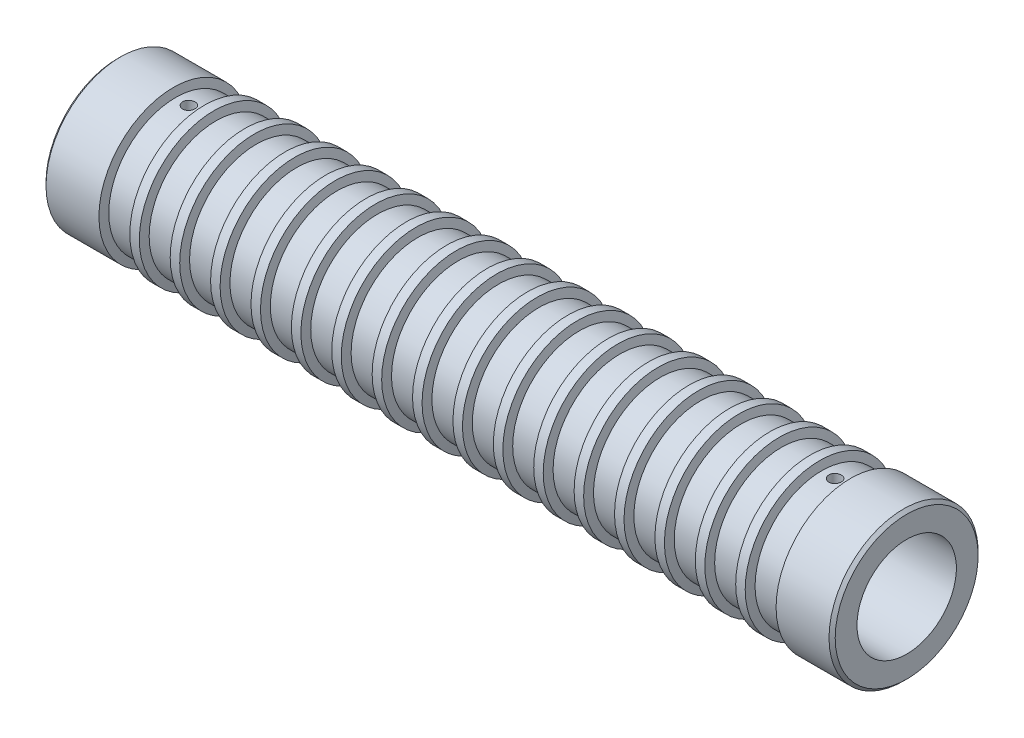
ISO-10303-21;
HEADER;
FILE_DESCRIPTION(('STEP AP214'),'2;1');
FILE_NAME('part.step','',(''),(''),'','','');
FILE_SCHEMA(('AUTOMOTIVE_DESIGN { 1 0 10303 214 1 1 1 1 }'));
ENDSEC;
DATA;
#1=APPLICATION_CONTEXT('core data for automotive mechanical design processes');
#2=APPLICATION_PROTOCOL_DEFINITION('international standard','automotive_design',2000,#1);
#3=PRODUCT_CONTEXT('',#1,'mechanical');
#4=PRODUCT('Part','Part','',(#3));
#5=PRODUCT_RELATED_PRODUCT_CATEGORY('part','',(#4));
#6=PRODUCT_DEFINITION_FORMATION('','',#4);
#7=PRODUCT_DEFINITION_CONTEXT('part definition',#1,'design');
#8=PRODUCT_DEFINITION('design','',#6,#7);
#9=PRODUCT_DEFINITION_SHAPE('','',#8);
#10=(LENGTH_UNIT() NAMED_UNIT(*) SI_UNIT(.MILLI.,.METRE.));
#11=(NAMED_UNIT(*) PLANE_ANGLE_UNIT() SI_UNIT($,.RADIAN.));
#12=(NAMED_UNIT(*) SI_UNIT($,.STERADIAN.) SOLID_ANGLE_UNIT());
#13=UNCERTAINTY_MEASURE_WITH_UNIT(LENGTH_MEASURE(1.E-05),#10,'distance_accuracy_value','');
#14=(GEOMETRIC_REPRESENTATION_CONTEXT(3) GLOBAL_UNCERTAINTY_ASSIGNED_CONTEXT((#13)) GLOBAL_UNIT_ASSIGNED_CONTEXT((#10,
#11,#12)) REPRESENTATION_CONTEXT('',''));
#15=CARTESIAN_POINT('',(0.,0.,0.));
#16=DIRECTION('',(0.,0.,1.));
#17=DIRECTION('',(1.,0.,0.));
#18=AXIS2_PLACEMENT_3D('',#15,#16,#17);
#19=CARTESIAN_POINT('',(-63.5,0.,0.));
#20=DIRECTION('',(-1.,0.,0.));
#21=DIRECTION('',(0.,0.,1.));
#22=AXIS2_PLACEMENT_3D('',#19,#20,#21);
#23=CYLINDRICAL_SURFACE('',#22,12.);
#24=CARTESIAN_POINT('',(34.9849364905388,0.,0.));
#25=DIRECTION('',(-1.,0.,0.));
#26=DIRECTION('',(0.,0.,1.));
#27=AXIS2_PLACEMENT_3D('',#24,#25,#26);
#28=CIRCLE('',#27,12.);
#29=CARTESIAN_POINT('',(34.9849364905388,0.,12.));
#30=VERTEX_POINT('',#29);
#31=EDGE_CURVE('E285',#30,#30,#28,.T.);
#32=ORIENTED_EDGE('',*,*,#31,.F.);
#33=EDGE_LOOP('',(#32));
#34=FACE_BOUND('',#33,.T.);
#35=CARTESIAN_POINT('',(36.5150635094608,0.,0.));
#36=DIRECTION('',(-1.,0.,0.));
#37=DIRECTION('',(0.,0.,1.));
#38=AXIS2_PLACEMENT_3D('',#35,#36,#37);
#39=CIRCLE('',#38,12.);
#40=CARTESIAN_POINT('',(36.5150635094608,0.,12.));
#41=VERTEX_POINT('',#40);
#42=EDGE_CURVE('E12',#41,#41,#39,.T.);
#43=ORIENTED_EDGE('',*,*,#42,.T.);
#44=EDGE_LOOP('',(#43));
#45=FACE_BOUND('',#44,.T.);
#46=ADVANCED_FACE('F47',(#34,#45),#23,.T.);
#47=CARTESIAN_POINT('',(36.85,0.,0.));
#48=DIRECTION('',(-1.,0.,0.));
#49=DIRECTION('',(0.,0.,1.));
#50=AXIS2_PLACEMENT_3D('',#47,#48,#49);
#51=CONICAL_SURFACE('',#50,10.75,1.30899693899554);
#52=ORIENTED_EDGE('',*,*,#42,.F.);
#53=EDGE_LOOP('',(#52));
#54=FACE_BOUND('',#53,.T.);
#55=CARTESIAN_POINT('',(36.85,0.,0.));
#56=DIRECTION('',(-1.,0.,0.));
#57=DIRECTION('',(0.,0.,1.));
#58=AXIS2_PLACEMENT_3D('',#55,#56,#57);
#59=CIRCLE('',#58,10.75);
#60=CARTESIAN_POINT('',(36.85,0.,10.75));
#61=VERTEX_POINT('',#60);
#62=EDGE_CURVE('E53',#61,#61,#59,.T.);
#63=ORIENTED_EDGE('',*,*,#62,.T.);
#64=EDGE_LOOP('',(#63));
#65=FACE_BOUND('',#64,.T.);
#66=ADVANCED_FACE('F533',(#54,#65),#51,.T.);
#67=CARTESIAN_POINT('',(-63.5,0.,0.));
#68=DIRECTION('',(-1.,0.,0.));
#69=DIRECTION('',(0.,0.,1.));
#70=AXIS2_PLACEMENT_3D('',#67,#68,#69);
#71=CYLINDRICAL_SURFACE('',#70,10.75);
#72=ORIENTED_EDGE('',*,*,#62,.F.);
#73=EDGE_LOOP('',(#72));
#74=FACE_BOUND('',#73,.T.);
#75=CARTESIAN_POINT('',(41.15,0.,0.));
#76=DIRECTION('',(-1.,0.,0.));
#77=DIRECTION('',(0.,0.,1.));
#78=AXIS2_PLACEMENT_3D('',#75,#76,#77);
#79=CIRCLE('',#78,10.75);
#80=CARTESIAN_POINT('',(41.15,0.,10.75));
#81=VERTEX_POINT('',#80);
#82=EDGE_CURVE('E57',#81,#81,#79,.T.);
#83=ORIENTED_EDGE('',*,*,#82,.T.);
#84=EDGE_LOOP('',(#83));
#85=FACE_BOUND('',#84,.T.);
#86=ADVANCED_FACE('F538',(#74,#85),#71,.T.);
#87=CARTESIAN_POINT('',(41.4849364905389,0.,0.));
#88=DIRECTION('',(1.,0.,0.));
#89=DIRECTION('',(0.,0.,-1.));
#90=AXIS2_PLACEMENT_3D('',#87,#88,#89);
#91=CONICAL_SURFACE('',#90,12.,1.30899693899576);
#92=ORIENTED_EDGE('',*,*,#82,.F.);
#93=EDGE_LOOP('',(#92));
#94=FACE_BOUND('',#93,.T.);
#95=CARTESIAN_POINT('',(41.4849364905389,0.,0.));
#96=DIRECTION('',(-1.,0.,0.));
#97=DIRECTION('',(0.,0.,1.));
#98=AXIS2_PLACEMENT_3D('',#95,#96,#97);
#99=CIRCLE('',#98,12.);
#100=CARTESIAN_POINT('',(41.4849364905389,0.,12.));
#101=VERTEX_POINT('',#100);
#102=EDGE_CURVE('E61',#101,#101,#99,.T.);
#103=ORIENTED_EDGE('',*,*,#102,.T.);
#104=EDGE_LOOP('',(#103));
#105=FACE_BOUND('',#104,.T.);
#106=ADVANCED_FACE('F545',(#94,#105),#91,.T.);
#107=CARTESIAN_POINT('',(-63.5,0.,0.));
#108=DIRECTION('',(-1.,0.,0.));
#109=DIRECTION('',(0.,0.,1.));
#110=AXIS2_PLACEMENT_3D('',#107,#108,#109);
#111=CYLINDRICAL_SURFACE('',#110,12.);
#112=ORIENTED_EDGE('',*,*,#102,.F.);
#113=EDGE_LOOP('',(#112));
#114=FACE_BOUND('',#113,.T.);
#115=CARTESIAN_POINT('',(43.0150635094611,0.,0.));
#116=DIRECTION('',(-1.,0.,0.));
#117=DIRECTION('',(0.,0.,1.));
#118=AXIS2_PLACEMENT_3D('',#115,#116,#117);
#119=CIRCLE('',#118,12.);
#120=CARTESIAN_POINT('',(43.0150635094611,0.,12.));
#121=VERTEX_POINT('',#120);
#122=EDGE_CURVE('E66',#121,#121,#119,.T.);
#123=ORIENTED_EDGE('',*,*,#122,.T.);
#124=EDGE_LOOP('',(#123));
#125=FACE_BOUND('',#124,.T.);
#126=ADVANCED_FACE('F551',(#114,#125),#111,.T.);
#127=CARTESIAN_POINT('',(43.35,0.,0.));
#128=DIRECTION('',(-1.,0.,0.));
#129=DIRECTION('',(0.,0.,1.));
#130=AXIS2_PLACEMENT_3D('',#127,#128,#129);
#131=CONICAL_SURFACE('',#130,10.75,1.30899693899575);
#132=ORIENTED_EDGE('',*,*,#122,.F.);
#133=EDGE_LOOP('',(#132));
#134=FACE_BOUND('',#133,.T.);
#135=CARTESIAN_POINT('',(43.35,0.,0.));
#136=DIRECTION('',(-1.,0.,0.));
#137=DIRECTION('',(0.,0.,1.));
#138=AXIS2_PLACEMENT_3D('',#135,#136,#137);
#139=CIRCLE('',#138,10.75);
#140=CARTESIAN_POINT('',(43.35,0.,10.75));
#141=VERTEX_POINT('',#140);
#142=EDGE_CURVE('E69',#141,#141,#139,.T.);
#143=ORIENTED_EDGE('',*,*,#142,.T.);
#144=EDGE_LOOP('',(#143));
#145=FACE_BOUND('',#144,.T.);
#146=ADVANCED_FACE('F555',(#134,#145),#131,.T.);
#147=CARTESIAN_POINT('',(-63.5,0.,0.));
#148=DIRECTION('',(-1.,0.,0.));
#149=DIRECTION('',(0.,0.,1.));
#150=AXIS2_PLACEMENT_3D('',#147,#148,#149);
#151=CYLINDRICAL_SURFACE('',#150,10.75);
#152=ORIENTED_EDGE('',*,*,#142,.F.);
#153=EDGE_LOOP('',(#152));
#154=FACE_BOUND('',#153,.T.);
#155=CARTESIAN_POINT('',(47.65,0.,0.));
#156=DIRECTION('',(-1.,0.,0.));
#157=DIRECTION('',(0.,0.,1.));
#158=AXIS2_PLACEMENT_3D('',#155,#156,#157);
#159=CIRCLE('',#158,10.75);
#160=CARTESIAN_POINT('',(47.65,0.,10.75));
#161=VERTEX_POINT('',#160);
#162=EDGE_CURVE('E72',#161,#161,#159,.T.);
#163=ORIENTED_EDGE('',*,*,#162,.T.);
#164=EDGE_LOOP('',(#163));
#165=FACE_BOUND('',#164,.T.);
#166=ADVANCED_FACE('F559',(#154,#165),#151,.T.);
#167=CARTESIAN_POINT('',(47.9849364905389,0.,0.));
#168=DIRECTION('',(1.,0.,0.));
#169=DIRECTION('',(0.,0.,-1.));
#170=AXIS2_PLACEMENT_3D('',#167,#168,#169);
#171=CONICAL_SURFACE('',#170,12.,1.30899693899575);
#172=ORIENTED_EDGE('',*,*,#162,.F.);
#173=EDGE_LOOP('',(#172));
#174=FACE_BOUND('',#173,.T.);
#175=CARTESIAN_POINT('',(47.9849364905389,0.,0.));
#176=DIRECTION('',(-1.,0.,0.));
#177=DIRECTION('',(0.,0.,1.));
#178=AXIS2_PLACEMENT_3D('',#175,#176,#177);
#179=CIRCLE('',#178,12.);
#180=CARTESIAN_POINT('',(47.9849364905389,0.,12.));
#181=VERTEX_POINT('',#180);
#182=EDGE_CURVE('E75',#181,#181,#179,.T.);
#183=ORIENTED_EDGE('',*,*,#182,.T.);
#184=EDGE_LOOP('',(#183));
#185=FACE_BOUND('',#184,.T.);
#186=ADVANCED_FACE('F563',(#174,#185),#171,.T.);
#187=CARTESIAN_POINT('',(-63.5,0.,0.));
#188=DIRECTION('',(-1.,0.,0.));
#189=DIRECTION('',(0.,0.,1.));
#190=AXIS2_PLACEMENT_3D('',#187,#188,#189);
#191=CYLINDRICAL_SURFACE('',#190,12.);
#192=ORIENTED_EDGE('',*,*,#182,.F.);
#193=EDGE_LOOP('',(#192));
#194=FACE_BOUND('',#193,.T.);
#195=CARTESIAN_POINT('',(49.5150635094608,0.,0.));
#196=DIRECTION('',(-1.,0.,0.));
#197=DIRECTION('',(0.,0.,1.));
#198=AXIS2_PLACEMENT_3D('',#195,#196,#197);
#199=CIRCLE('',#198,12.);
#200=CARTESIAN_POINT('',(49.5150635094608,0.,12.));
#201=VERTEX_POINT('',#200);
#202=EDGE_CURVE('E78',#201,#201,#199,.T.);
#203=ORIENTED_EDGE('',*,*,#202,.T.);
#204=EDGE_LOOP('',(#203));
#205=FACE_BOUND('',#204,.T.);
#206=ADVANCED_FACE('F567',(#194,#205),#191,.T.);
#207=CARTESIAN_POINT('',(49.85,0.,0.));
#208=DIRECTION('',(-1.,0.,0.));
#209=DIRECTION('',(0.,0.,1.));
#210=AXIS2_PLACEMENT_3D('',#207,#208,#209);
#211=CONICAL_SURFACE('',#210,10.75,1.30899693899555);
#212=ORIENTED_EDGE('',*,*,#202,.F.);
#213=EDGE_LOOP('',(#212));
#214=FACE_BOUND('',#213,.T.);
#215=CARTESIAN_POINT('',(49.85,0.,0.));
#216=DIRECTION('',(-1.,0.,0.));
#217=DIRECTION('',(0.,0.,1.));
#218=AXIS2_PLACEMENT_3D('',#215,#216,#217);
#219=CIRCLE('',#218,10.75);
#220=CARTESIAN_POINT('',(49.85,0.,10.75));
#221=VERTEX_POINT('',#220);
#222=EDGE_CURVE('E81',#221,#221,#219,.T.);
#223=ORIENTED_EDGE('',*,*,#222,.T.);
#224=EDGE_LOOP('',(#223));
#225=FACE_BOUND('',#224,.T.);
#226=ADVANCED_FACE('F571',(#214,#225),#211,.T.);
#227=CARTESIAN_POINT('',(-63.5,0.,0.));
#228=DIRECTION('',(-1.,0.,0.));
#229=DIRECTION('',(0.,0.,1.));
#230=AXIS2_PLACEMENT_3D('',#227,#228,#229);
#231=CYLINDRICAL_SURFACE('',#230,10.75);
#232=CARTESIAN_POINT('',(52.,10.7033873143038,0.999999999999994));
#233=CARTESIAN_POINT('',(51.9439600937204,10.7033879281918,0.999997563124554));
#234=CARTESIAN_POINT('',(51.8878826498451,10.7038321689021,0.995273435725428));
#235=CARTESIAN_POINT('',(51.7772811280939,10.7055609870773,0.976498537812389));
#236=CARTESIAN_POINT('',(51.7227588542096,10.7068465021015,0.962437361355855));
#237=CARTESIAN_POINT('',(51.6168854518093,10.7101110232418,0.925400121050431));
#238=CARTESIAN_POINT('',(51.5655324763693,10.7120896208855,0.902429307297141));
#239=CARTESIAN_POINT('',(51.4674226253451,10.7165168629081,0.848234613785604));
#240=CARTESIAN_POINT('',(51.4206648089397,10.7189654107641,0.817012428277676));
#241=CARTESIAN_POINT('',(51.3329129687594,10.7240653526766,0.747094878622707));
#242=CARTESIAN_POINT('',(51.2919355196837,10.7267172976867,0.708378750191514));
#243=CARTESIAN_POINT('',(51.2170502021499,10.7319202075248,0.62461653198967));
#244=CARTESIAN_POINT('',(51.1831426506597,10.7344711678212,0.579570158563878));
#245=CARTESIAN_POINT('',(51.1233031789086,10.7391900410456,0.484325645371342));
#246=CARTESIAN_POINT('',(51.097385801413,10.7413572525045,0.434118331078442));
#247=CARTESIAN_POINT('',(51.0543554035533,10.7450584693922,0.330040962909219));
#248=CARTESIAN_POINT('',(51.0372421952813,10.7465924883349,0.276170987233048));
#249=CARTESIAN_POINT('',(51.0123541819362,10.7488506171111,0.166464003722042));
#250=CARTESIAN_POINT('',(51.0045523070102,10.7495770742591,0.110633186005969));
#251=CARTESIAN_POINT('',(50.9984247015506,10.7501461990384,-0.00154986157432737));
#252=CARTESIAN_POINT('',(51.0000987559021,10.7499888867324,-0.0579020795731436));
#253=CARTESIAN_POINT('',(51.0128534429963,10.7488101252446,-0.169344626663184));
#254=CARTESIAN_POINT('',(51.0239049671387,10.7477913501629,-0.224438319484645));
#255=CARTESIAN_POINT('',(51.0550555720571,10.7450072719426,-0.331985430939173));
#256=CARTESIAN_POINT('',(51.0751547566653,10.7432419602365,-0.384438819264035));
#257=CARTESIAN_POINT('',(51.1238622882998,10.7391587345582,-0.485308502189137));
#258=CARTESIAN_POINT('',(51.1524835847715,10.7368399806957,-0.533718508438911));
#259=CARTESIAN_POINT('',(51.2174134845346,10.7319102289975,-0.62505862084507));
#260=CARTESIAN_POINT('',(51.2537222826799,10.7292992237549,-0.667988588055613));
#261=CARTESIAN_POINT('',(51.3331603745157,10.7240664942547,-0.747320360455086));
#262=CARTESIAN_POINT('',(51.3763149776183,10.7214447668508,-0.783696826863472));
#263=CARTESIAN_POINT('',(51.468131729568,10.7164959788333,-0.848693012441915));
#264=CARTESIAN_POINT('',(51.5167938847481,10.7141689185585,-0.877312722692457));
#265=CARTESIAN_POINT('',(51.6182631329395,10.7100726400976,-0.925982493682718));
#266=CARTESIAN_POINT('',(51.6710709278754,10.7083035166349,-0.946031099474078));
#267=CARTESIAN_POINT('',(51.7793233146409,10.705525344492,-0.976970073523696));
#268=CARTESIAN_POINT('',(51.8347678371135,10.7045162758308,-0.987860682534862));
#269=CARTESIAN_POINT('',(51.9464976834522,10.7033758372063,-1.00014215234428));
#270=CARTESIAN_POINT('',(52.00277908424,10.7032411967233,-1.00156841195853));
#271=CARTESIAN_POINT('',(52.1147801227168,10.7038562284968,-0.994973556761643));
#272=CARTESIAN_POINT('',(52.17049976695,10.7046058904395,-0.986952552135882));
#273=CARTESIAN_POINT('',(52.279693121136,10.7069020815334,-0.961720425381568));
#274=CARTESIAN_POINT('',(52.3331707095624,10.708447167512,-0.944525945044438));
#275=CARTESIAN_POINT('',(52.4364822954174,10.712158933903,-0.901451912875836));
#276=CARTESIAN_POINT('',(52.4863162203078,10.714325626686,-0.875572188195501));
#277=CARTESIAN_POINT('',(52.5810875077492,10.7190443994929,-0.815773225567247));
#278=CARTESIAN_POINT('',(52.626009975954,10.7215975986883,-0.781830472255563));
#279=CARTESIAN_POINT('',(52.7095323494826,10.7267979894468,-0.706902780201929));
#280=CARTESIAN_POINT('',(52.7481321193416,10.7294451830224,-0.665917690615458));
#281=CARTESIAN_POINT('',(52.8180349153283,10.7345451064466,-0.577915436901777));
#282=CARTESIAN_POINT('',(52.8493148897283,10.7369972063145,-0.530879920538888));
#283=CARTESIAN_POINT('',(52.9035317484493,10.7414215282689,-0.432202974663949));
#284=CARTESIAN_POINT('',(52.9264687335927,10.7433937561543,-0.380561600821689));
#285=CARTESIAN_POINT('',(52.9633092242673,10.7466332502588,-0.274220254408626));
#286=CARTESIAN_POINT('',(52.9772267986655,10.7479016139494,-0.219525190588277));
#287=CARTESIAN_POINT('',(52.9956793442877,10.7495949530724,-0.108562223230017));
#288=CARTESIAN_POINT('',(53.000214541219,10.7500199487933,-0.0522943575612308));
#289=CARTESIAN_POINT('',(52.9997706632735,10.7499786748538,0.0599902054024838));
#290=CARTESIAN_POINT('',(52.9948274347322,10.7495157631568,0.116007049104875));
#291=CARTESIAN_POINT('',(52.9756420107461,10.7477573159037,0.226411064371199));
#292=CARTESIAN_POINT('',(52.9613998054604,10.7464617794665,0.280798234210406));
#293=CARTESIAN_POINT('',(52.9240302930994,10.7431833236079,0.386399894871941));
#294=CARTESIAN_POINT('',(52.9009038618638,10.7412004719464,0.437614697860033));
#295=CARTESIAN_POINT('',(52.846426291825,10.7367687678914,0.535440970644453));
#296=CARTESIAN_POINT('',(52.8150752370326,10.734319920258,0.582052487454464));
#297=CARTESIAN_POINT('',(52.7449037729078,10.7292197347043,0.669532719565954));
#298=CARTESIAN_POINT('',(52.706056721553,10.7265676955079,0.710380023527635));
#299=CARTESIAN_POINT('',(52.6220469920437,10.7213659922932,0.784993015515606));
#300=CARTESIAN_POINT('',(52.5768827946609,10.7188163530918,0.818756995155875));
#301=CARTESIAN_POINT('',(52.4814121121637,10.7141019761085,0.878302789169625));
#302=CARTESIAN_POINT('',(52.431094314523,10.711938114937,0.904066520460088));
#303=CARTESIAN_POINT('',(52.3268598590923,10.7082508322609,0.946745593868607));
#304=CARTESIAN_POINT('',(52.2729473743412,10.7067266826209,0.96367100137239));
#305=CARTESIAN_POINT('',(52.182269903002,10.7048791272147,0.983932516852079));
#306=CARTESIAN_POINT('',(52.1460862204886,10.704322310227,0.989949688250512));
#307=CARTESIAN_POINT('',(52.0732737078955,10.7035762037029,0.997984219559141));
#308=CARTESIAN_POINT('',(52.0366448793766,10.7033869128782,1.00000159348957));
#309=CARTESIAN_POINT('',(52.,10.7033873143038,0.999999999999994));
#310=B_SPLINE_CURVE_WITH_KNOTS('',3,(#232,#233,#234,#235,#236,#237,#238,#239,#240,#241,#242,
#243,#244,#245,#246,#247,#248,#249,#250,#251,#252,#253,#254,#255,#256,#257,#258,#259,#260,#261,
#262,#263,#264,#265,#266,#267,#268,#269,#270,#271,#272,#273,#274,#275,#276,#277,#278,#279,#280,
#281,#282,#283,#284,#285,#286,#287,#288,#289,#290,#291,#292,#293,#294,#295,#296,#297,#298,#299,
#300,#301,#302,#303,#304,#305,#306,#307,#308,#309),.UNSPECIFIED.,.T.,.F.,(4,2,2,2,2,2,2,2,2,2,2,
2,2,2,2,2,2,2,2,2,2,2,2,2,2,2,2,2,2,2,2,2,2,2,2,2,2,2,4),(0.,0.167985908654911,
0.336159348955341,0.504233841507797,0.672273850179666,0.840786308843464,1.00930632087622,
1.17813126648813,1.34695260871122,1.51528194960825,1.68360746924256,1.85141239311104,
2.01921924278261,2.18728238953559,2.35534979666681,2.52405369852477,2.69275779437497,
2.86149051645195,3.03021880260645,3.19831564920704,3.36641053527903,3.53420150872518,
3.70199582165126,3.87028563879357,4.03857906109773,4.20739555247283,4.37621000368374,
4.54476049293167,4.71330692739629,4.88121719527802,5.04912764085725,5.21702153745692,
5.38491371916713,5.55341399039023,5.72195485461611,5.89087394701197,6.05960024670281,
6.16944777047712,6.27929490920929),.UNSPECIFIED.);
#311=CARTESIAN_POINT('',(52.,10.7033873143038,0.999999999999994));
#312=VERTEX_POINT('',#311);
#313=EDGE_CURVE('E583',#312,#312,#310,.T.);
#314=ORIENTED_EDGE('',*,*,#313,.T.);
#315=EDGE_LOOP('',(#314));
#316=FACE_BOUND('',#315,.T.);
#317=ORIENTED_EDGE('',*,*,#222,.F.);
#318=EDGE_LOOP('',(#317));
#319=FACE_BOUND('',#318,.T.);
#320=CARTESIAN_POINT('',(54.15,0.,0.));
#321=DIRECTION('',(-1.,0.,0.));
#322=DIRECTION('',(0.,0.,1.));
#323=AXIS2_PLACEMENT_3D('',#320,#321,#322);
#324=CIRCLE('',#323,10.75);
#325=CARTESIAN_POINT('',(54.15,0.,10.75));
#326=VERTEX_POINT('',#325);
#327=EDGE_CURVE('E84',#326,#326,#324,.T.);
#328=ORIENTED_EDGE('',*,*,#327,.T.);
#329=EDGE_LOOP('',(#328));
#330=FACE_BOUND('',#329,.T.);
#331=ADVANCED_FACE('F575',(#316,#319,#330),#231,.T.);
#332=CARTESIAN_POINT('',(54.4849364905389,0.,0.));
#333=DIRECTION('',(1.,0.,0.));
#334=DIRECTION('',(0.,0.,-1.));
#335=AXIS2_PLACEMENT_3D('',#332,#333,#334);
#336=CONICAL_SURFACE('',#335,12.,1.30899693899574);
#337=ORIENTED_EDGE('',*,*,#327,.F.);
#338=EDGE_LOOP('',(#337));
#339=FACE_BOUND('',#338,.T.);
#340=CARTESIAN_POINT('',(54.4849364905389,0.,0.));
#341=DIRECTION('',(-1.,0.,0.));
#342=DIRECTION('',(0.,0.,1.));
#343=AXIS2_PLACEMENT_3D('',#340,#341,#342);
#344=CIRCLE('',#343,12.);
#345=CARTESIAN_POINT('',(54.4849364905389,0.,12.));
#346=VERTEX_POINT('',#345);
#347=EDGE_CURVE('E87',#346,#346,#344,.T.);
#348=ORIENTED_EDGE('',*,*,#347,.T.);
#349=EDGE_LOOP('',(#348));
#350=FACE_BOUND('',#349,.T.);
#351=ADVANCED_FACE('F580',(#339,#350),#336,.T.);
#352=CARTESIAN_POINT('',(-63.5,0.,0.));
#353=DIRECTION('',(-1.,0.,0.));
#354=DIRECTION('',(0.,0.,1.));
#355=AXIS2_PLACEMENT_3D('',#352,#353,#354);
#356=CYLINDRICAL_SURFACE('',#355,12.);
#357=ORIENTED_EDGE('',*,*,#347,.F.);
#358=EDGE_LOOP('',(#357));
#359=FACE_BOUND('',#358,.T.);
#360=CARTESIAN_POINT('',(63.,0.,0.));
#361=DIRECTION('',(-1.,0.,0.));
#362=DIRECTION('',(0.,0.,1.));
#363=AXIS2_PLACEMENT_3D('',#360,#361,#362);
#364=CIRCLE('',#363,12.);
#365=CARTESIAN_POINT('',(63.,0.,12.));
#366=VERTEX_POINT('',#365);
#367=EDGE_CURVE('E90',#366,#366,#364,.T.);
#368=ORIENTED_EDGE('',*,*,#367,.T.);
#369=EDGE_LOOP('',(#368));
#370=FACE_BOUND('',#369,.T.);
#371=ADVANCED_FACE('F608',(#359,#370),#356,.T.);
#372=CARTESIAN_POINT('',(63.5,0.,0.));
#373=DIRECTION('',(-1.,0.,0.));
#374=DIRECTION('',(0.,0.,1.));
#375=AXIS2_PLACEMENT_3D('',#372,#373,#374);
#376=CONICAL_SURFACE('',#375,11.5,0.78539816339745);
#377=ORIENTED_EDGE('',*,*,#367,.F.);
#378=EDGE_LOOP('',(#377));
#379=FACE_BOUND('',#378,.T.);
#380=CARTESIAN_POINT('',(63.5,0.,0.));
#381=DIRECTION('',(-1.,0.,0.));
#382=DIRECTION('',(0.,0.,1.));
#383=AXIS2_PLACEMENT_3D('',#380,#381,#382);
#384=CIRCLE('',#383,11.5);
#385=CARTESIAN_POINT('',(63.5,0.,11.5));
#386=VERTEX_POINT('',#385);
#387=EDGE_CURVE('E93',#386,#386,#384,.T.);
#388=ORIENTED_EDGE('',*,*,#387,.T.);
#389=EDGE_LOOP('',(#388));
#390=FACE_BOUND('',#389,.T.);
#391=ADVANCED_FACE('F613',(#379,#390),#376,.T.);
#392=CARTESIAN_POINT('',(63.5,8.,0.));
#393=DIRECTION('',(-1.,0.,0.));
#394=DIRECTION('',(0.,0.,1.));
#395=AXIS2_PLACEMENT_3D('',#392,#393,#394);
#396=PLANE('',#395);
#397=ORIENTED_EDGE('',*,*,#387,.F.);
#398=EDGE_LOOP('',(#397));
#399=FACE_BOUND('',#398,.T.);
#400=CARTESIAN_POINT('',(63.5,0.,0.));
#401=DIRECTION('',(-1.,0.,0.));
#402=DIRECTION('',(0.,0.,1.));
#403=AXIS2_PLACEMENT_3D('',#400,#401,#402);
#404=CIRCLE('',#403,8.);
#405=CARTESIAN_POINT('',(63.5,0.,8.));
#406=VERTEX_POINT('',#405);
#407=EDGE_CURVE('E96',#406,#406,#404,.T.);
#408=ORIENTED_EDGE('',*,*,#407,.T.);
#409=EDGE_LOOP('',(#408));
#410=FACE_BOUND('',#409,.T.);
#411=ADVANCED_FACE('F618',(#399,#410),#396,.F.);
#412=CARTESIAN_POINT('',(-63.5,0.,0.));
#413=DIRECTION('',(-1.,0.,0.));
#414=DIRECTION('',(0.,0.,1.));
#415=AXIS2_PLACEMENT_3D('',#412,#413,#414);
#416=CYLINDRICAL_SURFACE('',#415,8.);
#417=CARTESIAN_POINT('',(52.,7.93725393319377,0.999999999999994));
#418=CARTESIAN_POINT('',(52.0559345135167,7.93725473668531,0.999997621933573));
#419=CARTESIAN_POINT('',(52.1119039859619,7.93785158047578,0.995291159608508));
#420=CARTESIAN_POINT('',(52.2222852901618,7.94017356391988,0.97659056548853));
#421=CARTESIAN_POINT('',(52.2766954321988,7.94189988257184,0.962586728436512));
#422=CARTESIAN_POINT('',(52.3823439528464,7.94628229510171,0.925710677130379));
#423=CARTESIAN_POINT('',(52.4335844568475,7.9489377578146,0.902844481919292));
#424=CARTESIAN_POINT('',(52.5314913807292,7.95487849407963,0.848905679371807));
#425=CARTESIAN_POINT('',(52.5781585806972,7.95816365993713,0.817834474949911));
#426=CARTESIAN_POINT('',(52.6658648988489,7.9650142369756,0.748181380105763));
#427=CARTESIAN_POINT('',(52.7068747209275,7.96858096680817,0.709562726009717));
#428=CARTESIAN_POINT('',(52.7818491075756,7.97558093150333,0.625990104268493));
#429=CARTESIAN_POINT('',(52.8158133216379,7.97901415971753,0.581035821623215));
#430=CARTESIAN_POINT('',(52.8758374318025,7.98537377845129,0.485883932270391));
#431=CARTESIAN_POINT('',(52.9018708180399,7.98829845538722,0.435669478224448));
#432=CARTESIAN_POINT('',(52.9451244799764,7.99329694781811,0.33153868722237));
#433=CARTESIAN_POINT('',(52.9623450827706,7.99537079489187,0.277622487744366));
#434=CARTESIAN_POINT('',(52.9873968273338,7.99842467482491,0.16791827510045));
#435=CARTESIAN_POINT('',(52.9952766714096,7.99941037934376,0.112141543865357));
#436=CARTESIAN_POINT('',(53.0015741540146,8.00019627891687,4.92802746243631E-05));
#437=CARTESIAN_POINT('',(52.999992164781,7.99999652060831,-0.0562662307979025));
#438=CARTESIAN_POINT('',(52.987449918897,7.99843859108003,-0.167506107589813));
#439=CARTESIAN_POINT('',(52.9765420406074,7.99708688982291,-0.222436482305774));
#440=CARTESIAN_POINT('',(52.945739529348,7.99338422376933,-0.329680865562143));
#441=CARTESIAN_POINT('',(52.9258447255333,7.99103323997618,-0.381994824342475));
#442=CARTESIAN_POINT('',(52.8775774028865,7.98558503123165,-0.482683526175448));
#443=CARTESIAN_POINT('',(52.8491822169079,7.98248581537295,-0.531047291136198));
#444=CARTESIAN_POINT('',(52.7847366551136,7.97588787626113,-0.62234298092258));
#445=CARTESIAN_POINT('',(52.7486859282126,7.97238913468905,-0.665274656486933));
#446=CARTESIAN_POINT('',(52.6696592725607,7.96535547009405,-0.744795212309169));
#447=CARTESIAN_POINT('',(52.6266376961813,7.96182046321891,-0.781338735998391));
#448=CARTESIAN_POINT('',(52.535047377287,7.95513628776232,-0.846693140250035));
#449=CARTESIAN_POINT('',(52.4864786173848,7.95198712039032,-0.87550399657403));
#450=CARTESIAN_POINT('',(52.3851322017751,7.94643121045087,-0.924577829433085));
#451=CARTESIAN_POINT('',(52.3323527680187,7.94402478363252,-0.944837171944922));
#452=CARTESIAN_POINT('',(52.2241042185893,7.94023296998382,-0.976192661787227));
#453=CARTESIAN_POINT('',(52.1686352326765,7.93884753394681,-0.987289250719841));
#454=CARTESIAN_POINT('',(52.0569827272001,7.9372635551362,-0.999944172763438));
#455=CARTESIAN_POINT('',(52.0008065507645,7.9370570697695,-1.00156633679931));
#456=CARTESIAN_POINT('',(51.8889832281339,7.93783336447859,-0.995394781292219));
#457=CARTESIAN_POINT('',(51.8333360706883,7.9388161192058,-0.98760126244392));
#458=CARTESIAN_POINT('',(51.7243416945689,7.94185291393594,-0.962873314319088));
#459=CARTESIAN_POINT('',(51.6709873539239,7.94390333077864,-0.945969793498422));
#460=CARTESIAN_POINT('',(51.5678703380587,7.94884147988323,-0.90353348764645));
#461=CARTESIAN_POINT('',(51.5181077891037,7.95172924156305,-0.878000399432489));
#462=CARTESIAN_POINT('',(51.4232981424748,7.95803572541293,-0.818872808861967));
#463=CARTESIAN_POINT('',(51.3782773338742,7.96145717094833,-0.785236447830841));
#464=CARTESIAN_POINT('',(51.294497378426,7.96843695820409,-0.710916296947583));
#465=CARTESIAN_POINT('',(51.2557384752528,7.97199530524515,-0.670232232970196));
#466=CARTESIAN_POINT('',(51.1853583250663,7.97887235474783,-0.582692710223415));
#467=CARTESIAN_POINT('',(51.153779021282,7.98218957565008,-0.535803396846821));
#468=CARTESIAN_POINT('',(51.0989447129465,7.98818845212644,-0.437349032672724));
#469=CARTESIAN_POINT('',(51.0756895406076,7.99087012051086,-0.385784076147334));
#470=CARTESIAN_POINT('',(51.0382328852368,7.99528916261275,-0.279581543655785));
#471=CARTESIAN_POINT('',(51.0240071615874,7.99702906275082,-0.224952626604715));
#472=CARTESIAN_POINT('',(51.0049343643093,7.99937901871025,-0.11405842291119));
#473=CARTESIAN_POINT('',(51.0000868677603,7.99998912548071,-0.0577932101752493));
#474=CARTESIAN_POINT('',(50.9999160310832,8.00001051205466,0.0543668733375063));
#475=CARTESIAN_POINT('',(51.0045280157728,7.99942993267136,0.110261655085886));
#476=CARTESIAN_POINT('',(51.0230082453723,7.99715136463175,0.220475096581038));
#477=CARTESIAN_POINT('',(51.0368764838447,7.99545337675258,0.274793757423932));
#478=CARTESIAN_POINT('',(51.0734552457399,7.99112994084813,0.380304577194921));
#479=CARTESIAN_POINT('',(51.0961626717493,7.98850481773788,0.431497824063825));
#480=CARTESIAN_POINT('',(51.149768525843,7.98261779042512,0.529357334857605));
#481=CARTESIAN_POINT('',(51.1806670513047,7.97935587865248,0.576023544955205));
#482=CARTESIAN_POINT('',(51.2500172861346,7.97253277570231,0.663834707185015));
#483=CARTESIAN_POINT('',(51.2885171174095,7.96896976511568,0.704941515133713));
#484=CARTESIAN_POINT('',(51.3718771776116,7.96196063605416,0.780136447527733));
#485=CARTESIAN_POINT('',(51.4167389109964,7.95851454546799,0.814222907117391));
#486=CARTESIAN_POINT('',(51.511747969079,7.95211524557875,0.874522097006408));
#487=CARTESIAN_POINT('',(51.561915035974,7.94916399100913,0.900703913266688));
#488=CARTESIAN_POINT('',(51.6659426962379,7.94411143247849,0.944234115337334));
#489=CARTESIAN_POINT('',(51.7197991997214,7.94200920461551,0.961592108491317));
#490=CARTESIAN_POINT('',(51.8116119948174,7.93940314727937,0.982826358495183));
#491=CARTESIAN_POINT('',(51.848989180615,7.93860120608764,0.989257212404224));
#492=CARTESIAN_POINT('',(51.9242388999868,7.93752632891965,0.997844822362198));
#493=CARTESIAN_POINT('',(51.9621114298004,7.93725338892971,1.00000161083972));
#494=CARTESIAN_POINT('',(52.,7.93725393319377,0.999999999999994));
#495=B_SPLINE_CURVE_WITH_KNOTS('',3,(#417,#418,#419,#420,#421,#422,#423,#424,#425,#426,#427,
#428,#429,#430,#431,#432,#433,#434,#435,#436,#437,#438,#439,#440,#441,#442,#443,#444,#445,#446,
#447,#448,#449,#450,#451,#452,#453,#454,#455,#456,#457,#458,#459,#460,#461,#462,#463,#464,#465,
#466,#467,#468,#469,#470,#471,#472,#473,#474,#475,#476,#477,#478,#479,#480,#481,#482,#483,#484,
#485,#486,#487,#488,#489,#490,#491,#492,#493,#494),.UNSPECIFIED.,.T.,.F.,(4,2,2,2,2,2,2,2,2,2,2,
2,2,2,2,2,2,2,2,2,2,2,2,2,2,2,2,2,2,2,2,2,2,2,2,2,2,2,4),(0.,0.167665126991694,
0.335505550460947,0.503232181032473,0.670930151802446,0.839466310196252,1.0080108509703,
1.17711274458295,1.34620836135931,1.51441838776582,1.68262179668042,1.84988665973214,
2.01715470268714,2.1848728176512,2.3525986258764,2.52147078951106,2.69034348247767,
2.85928786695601,3.02822410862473,3.1960208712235,3.36381405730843,3.5310415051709,
3.69827482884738,3.86639127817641,4.03451426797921,4.20359554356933,4.37267341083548,
4.54129542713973,4.70990983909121,4.87737526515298,5.04484057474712,5.21224725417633,
5.37965592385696,5.54816051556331,5.71670502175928,5.8859003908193,6.05491114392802,
6.16848395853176,6.28205591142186),.UNSPECIFIED.);
#496=CARTESIAN_POINT('',(52.,7.93725393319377,0.999999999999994));
#497=VERTEX_POINT('',#496);
#498=EDGE_CURVE('E588',#497,#497,#495,.T.);
#499=ORIENTED_EDGE('',*,*,#498,.T.);
#500=EDGE_LOOP('',(#499));
#501=FACE_BOUND('',#500,.T.);
#502=ORIENTED_EDGE('',*,*,#407,.F.);
#503=EDGE_LOOP('',(#502));
#504=FACE_BOUND('',#503,.T.);
#505=CARTESIAN_POINT('',(47.5,0.,0.));
#506=DIRECTION('',(-1.,0.,0.));
#507=DIRECTION('',(0.,0.,1.));
#508=AXIS2_PLACEMENT_3D('',#505,#506,#507);
#509=CIRCLE('',#508,8.);
#510=CARTESIAN_POINT('',(47.5,0.,8.));
#511=VERTEX_POINT('',#510);
#512=EDGE_CURVE('E99',#511,#511,#509,.T.);
#513=ORIENTED_EDGE('',*,*,#512,.T.);
#514=EDGE_LOOP('',(#513));
#515=FACE_BOUND('',#514,.T.);
#516=ADVANCED_FACE('F624',(#501,#504,#515),#416,.F.);
#517=CARTESIAN_POINT('',(47.5,7.5,0.));
#518=DIRECTION('',(-1.,0.,0.));
#519=DIRECTION('',(0.,0.,1.));
#520=AXIS2_PLACEMENT_3D('',#517,#518,#519);
#521=PLANE('',#520);
#522=ORIENTED_EDGE('',*,*,#512,.F.);
#523=EDGE_LOOP('',(#522));
#524=FACE_BOUND('',#523,.T.);
#525=CARTESIAN_POINT('',(47.5,0.,0.));
#526=DIRECTION('',(-1.,0.,0.));
#527=DIRECTION('',(0.,0.,1.));
#528=AXIS2_PLACEMENT_3D('',#525,#526,#527);
#529=CIRCLE('',#528,7.5);
#530=CARTESIAN_POINT('',(47.5,0.,7.5));
#531=VERTEX_POINT('',#530);
#532=EDGE_CURVE('E102',#531,#531,#529,.T.);
#533=ORIENTED_EDGE('',*,*,#532,.T.);
#534=EDGE_LOOP('',(#533));
#535=FACE_BOUND('',#534,.T.);
#536=ADVANCED_FACE('F630',(#524,#535),#521,.F.);
#537=CARTESIAN_POINT('',(-63.5,0.,0.));
#538=DIRECTION('',(-1.,0.,0.));
#539=DIRECTION('',(0.,0.,1.));
#540=AXIS2_PLACEMENT_3D('',#537,#538,#539);
#541=CYLINDRICAL_SURFACE('',#540,7.5);
#542=ORIENTED_EDGE('',*,*,#532,.F.);
#543=EDGE_LOOP('',(#542));
#544=FACE_BOUND('',#543,.T.);
#545=CARTESIAN_POINT('',(-47.5,0.,0.));
#546=DIRECTION('',(-1.,0.,0.));
#547=DIRECTION('',(0.,0.,1.));
#548=AXIS2_PLACEMENT_3D('',#545,#546,#547);
#549=CIRCLE('',#548,7.5);
#550=CARTESIAN_POINT('',(-47.5,0.,7.5));
#551=VERTEX_POINT('',#550);
#552=EDGE_CURVE('E105',#551,#551,#549,.T.);
#553=ORIENTED_EDGE('',*,*,#552,.T.);
#554=EDGE_LOOP('',(#553));
#555=FACE_BOUND('',#554,.T.);
#556=ADVANCED_FACE('F637',(#544,#555),#541,.F.);
#557=CARTESIAN_POINT('',(-47.5,8.,0.));
#558=DIRECTION('',(1.,0.,0.));
#559=DIRECTION('',(0.,0.,-1.));
#560=AXIS2_PLACEMENT_3D('',#557,#558,#559);
#561=PLANE('',#560);
#562=ORIENTED_EDGE('',*,*,#552,.F.);
#563=EDGE_LOOP('',(#562));
#564=FACE_BOUND('',#563,.T.);
#565=CARTESIAN_POINT('',(-47.5,0.,0.));
#566=DIRECTION('',(-1.,0.,0.));
#567=DIRECTION('',(0.,0.,1.));
#568=AXIS2_PLACEMENT_3D('',#565,#566,#567);
#569=CIRCLE('',#568,8.);
#570=CARTESIAN_POINT('',(-47.5,0.,8.));
#571=VERTEX_POINT('',#570);
#572=EDGE_CURVE('E108',#571,#571,#569,.T.);
#573=ORIENTED_EDGE('',*,*,#572,.T.);
#574=EDGE_LOOP('',(#573));
#575=FACE_BOUND('',#574,.T.);
#576=ADVANCED_FACE('F643',(#564,#575),#561,.F.);
#577=CARTESIAN_POINT('',(-63.5,0.,0.));
#578=DIRECTION('',(-1.,0.,0.));
#579=DIRECTION('',(0.,0.,1.));
#580=AXIS2_PLACEMENT_3D('',#577,#578,#579);
#581=CYLINDRICAL_SURFACE('',#580,8.);
#582=CARTESIAN_POINT('',(-52.,7.93725393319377,0.999999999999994));
#583=CARTESIAN_POINT('',(-51.9440654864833,7.93725473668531,0.999997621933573));
#584=CARTESIAN_POINT('',(-51.8880960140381,7.93785158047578,0.995291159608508));
#585=CARTESIAN_POINT('',(-51.7777147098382,7.94017356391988,0.976590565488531));
#586=CARTESIAN_POINT('',(-51.7233045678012,7.94189988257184,0.962586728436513));
#587=CARTESIAN_POINT('',(-51.6176560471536,7.94628229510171,0.925710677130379));
#588=CARTESIAN_POINT('',(-51.5664155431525,7.9489377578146,0.90284448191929));
#589=CARTESIAN_POINT('',(-51.4685086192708,7.95487849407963,0.848905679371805));
#590=CARTESIAN_POINT('',(-51.4218414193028,7.95816365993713,0.81783447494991));
#591=CARTESIAN_POINT('',(-51.3341351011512,7.9650142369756,0.748181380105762));
#592=CARTESIAN_POINT('',(-51.2931252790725,7.96858096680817,0.709562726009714));
#593=CARTESIAN_POINT('',(-51.2181508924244,7.97558093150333,0.62599010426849));
#594=CARTESIAN_POINT('',(-51.1841866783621,7.97901415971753,0.581035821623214));
#595=CARTESIAN_POINT('',(-51.1241625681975,7.98537377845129,0.485883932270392));
#596=CARTESIAN_POINT('',(-51.0981291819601,7.98829845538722,0.435669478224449));
#597=CARTESIAN_POINT('',(-51.0548755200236,7.99329694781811,0.33153868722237));
#598=CARTESIAN_POINT('',(-51.0376549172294,7.99537079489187,0.277622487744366));
#599=CARTESIAN_POINT('',(-51.0126031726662,7.99842467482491,0.16791827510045));
#600=CARTESIAN_POINT('',(-51.0047233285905,7.99941037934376,0.112141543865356));
#601=CARTESIAN_POINT('',(-50.9984258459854,8.00019627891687,4.92802746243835E-05));
#602=CARTESIAN_POINT('',(-51.000007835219,7.99999652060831,-0.0562662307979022));
#603=CARTESIAN_POINT('',(-51.012550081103,7.99843859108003,-0.167506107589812));
#604=CARTESIAN_POINT('',(-51.0234579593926,7.99708688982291,-0.222436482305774));
#605=CARTESIAN_POINT('',(-51.054260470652,7.99338422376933,-0.329680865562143));
#606=CARTESIAN_POINT('',(-51.0741552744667,7.99103323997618,-0.381994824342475));
#607=CARTESIAN_POINT('',(-51.1224225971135,7.98558503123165,-0.482683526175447));
#608=CARTESIAN_POINT('',(-51.1508177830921,7.98248581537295,-0.531047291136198));
#609=CARTESIAN_POINT('',(-51.2152633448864,7.97588787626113,-0.622342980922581));
#610=CARTESIAN_POINT('',(-51.2513140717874,7.97238913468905,-0.665274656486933));
#611=CARTESIAN_POINT('',(-51.3303407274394,7.96535547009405,-0.744795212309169));
#612=CARTESIAN_POINT('',(-51.3733623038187,7.96182046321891,-0.78133873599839));
#613=CARTESIAN_POINT('',(-51.464952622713,7.95513628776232,-0.846693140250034));
#614=CARTESIAN_POINT('',(-51.5135213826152,7.95198712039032,-0.87550399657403));
#615=CARTESIAN_POINT('',(-51.6148677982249,7.94643121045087,-0.924577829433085));
#616=CARTESIAN_POINT('',(-51.6676472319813,7.94402478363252,-0.944837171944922));
#617=CARTESIAN_POINT('',(-51.7758957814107,7.94023296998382,-0.976192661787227));
#618=CARTESIAN_POINT('',(-51.8313647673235,7.93884753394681,-0.987289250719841));
#619=CARTESIAN_POINT('',(-51.9430172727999,7.9372635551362,-0.999944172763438));
#620=CARTESIAN_POINT('',(-51.9991934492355,7.9370570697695,-1.00156633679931));
#621=CARTESIAN_POINT('',(-52.1110167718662,7.93783336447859,-0.995394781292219));
#622=CARTESIAN_POINT('',(-52.1666639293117,7.9388161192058,-0.98760126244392));
#623=CARTESIAN_POINT('',(-52.2756583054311,7.94185291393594,-0.962873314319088));
#624=CARTESIAN_POINT('',(-52.3290126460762,7.94390333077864,-0.945969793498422));
#625=CARTESIAN_POINT('',(-52.4321296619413,7.94884147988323,-0.90353348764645));
#626=CARTESIAN_POINT('',(-52.4818922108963,7.95172924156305,-0.878000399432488));
#627=CARTESIAN_POINT('',(-52.5767018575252,7.95803572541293,-0.818872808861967));
#628=CARTESIAN_POINT('',(-52.6217226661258,7.96145717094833,-0.785236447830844));
#629=CARTESIAN_POINT('',(-52.705502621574,7.96843695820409,-0.710916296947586));
#630=CARTESIAN_POINT('',(-52.7442615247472,7.97199530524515,-0.670232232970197));
#631=CARTESIAN_POINT('',(-52.8146416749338,7.97887235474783,-0.582692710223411));
#632=CARTESIAN_POINT('',(-52.846220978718,7.98218957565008,-0.535803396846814));
#633=CARTESIAN_POINT('',(-52.9010552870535,7.98818845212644,-0.437349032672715));
#634=CARTESIAN_POINT('',(-52.9243104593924,7.99087012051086,-0.38578407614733));
#635=CARTESIAN_POINT('',(-52.9617671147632,7.99528916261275,-0.279581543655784));
#636=CARTESIAN_POINT('',(-52.9759928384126,7.99702906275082,-0.224952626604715));
#637=CARTESIAN_POINT('',(-52.9950656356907,7.99937901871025,-0.114058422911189));
#638=CARTESIAN_POINT('',(-52.9999131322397,7.99998912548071,-0.057793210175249));
#639=CARTESIAN_POINT('',(-53.0000839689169,8.00001051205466,0.0543668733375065));
#640=CARTESIAN_POINT('',(-52.9954719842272,7.99942993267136,0.110261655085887));
#641=CARTESIAN_POINT('',(-52.9769917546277,7.99715136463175,0.220475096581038));
#642=CARTESIAN_POINT('',(-52.9631235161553,7.99545337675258,0.274793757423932));
#643=CARTESIAN_POINT('',(-52.9265447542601,7.99112994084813,0.380304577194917));
#644=CARTESIAN_POINT('',(-52.9038373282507,7.98850481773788,0.431497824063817));
#645=CARTESIAN_POINT('',(-52.850231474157,7.98261779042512,0.529357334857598));
#646=CARTESIAN_POINT('',(-52.8193329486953,7.97935587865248,0.576023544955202));
#647=CARTESIAN_POINT('',(-52.7499827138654,7.97253277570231,0.663834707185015));
#648=CARTESIAN_POINT('',(-52.7114828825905,7.96896976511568,0.704941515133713));
#649=CARTESIAN_POINT('',(-52.6281228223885,7.96196063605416,0.780136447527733));
#650=CARTESIAN_POINT('',(-52.5832610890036,7.95851454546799,0.814222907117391));
#651=CARTESIAN_POINT('',(-52.4882520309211,7.95211524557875,0.874522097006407));
#652=CARTESIAN_POINT('',(-52.438084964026,7.94916399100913,0.900703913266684));
#653=CARTESIAN_POINT('',(-52.3340573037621,7.94411143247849,0.944234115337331));
#654=CARTESIAN_POINT('',(-52.2802008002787,7.94200920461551,0.961592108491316));
#655=CARTESIAN_POINT('',(-52.1883880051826,7.93940314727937,0.982826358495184));
#656=CARTESIAN_POINT('',(-52.151010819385,7.93860120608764,0.989257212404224));
#657=CARTESIAN_POINT('',(-52.0757611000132,7.93752632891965,0.997844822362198));
#658=CARTESIAN_POINT('',(-52.0378885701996,7.93725338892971,1.00000161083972));
#659=CARTESIAN_POINT('',(-52.,7.93725393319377,0.999999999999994));
#660=B_SPLINE_CURVE_WITH_KNOTS('',3,(#582,#583,#584,#585,#586,#587,#588,#589,#590,#591,#592,
#593,#594,#595,#596,#597,#598,#599,#600,#601,#602,#603,#604,#605,#606,#607,#608,#609,#610,#611,
#612,#613,#614,#615,#616,#617,#618,#619,#620,#621,#622,#623,#624,#625,#626,#627,#628,#629,#630,
#631,#632,#633,#634,#635,#636,#637,#638,#639,#640,#641,#642,#643,#644,#645,#646,#647,#648,#649,
#650,#651,#652,#653,#654,#655,#656,#657,#658,#659),.UNSPECIFIED.,.T.,.F.,(4,2,2,2,2,2,2,2,2,2,2,
2,2,2,2,2,2,2,2,2,2,2,2,2,2,2,2,2,2,2,2,2,2,2,2,2,2,2,4),(0.,0.167665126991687,
0.335505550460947,0.503232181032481,0.670930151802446,0.839466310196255,1.0080108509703,
1.17711274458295,1.34620836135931,1.51441838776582,1.68262179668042,1.84988665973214,
2.01715470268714,2.1848728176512,2.3525986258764,2.52147078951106,2.69034348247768,
2.85928786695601,3.02822410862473,3.1960208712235,3.36381405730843,3.5310415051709,
3.69827482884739,3.86639127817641,4.03451426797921,4.20359554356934,4.37267341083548,
4.54129542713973,4.70990983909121,4.87737526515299,5.04484057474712,5.21224725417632,
5.37965592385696,5.54816051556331,5.71670502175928,5.88590039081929,6.05491114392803,
6.16848395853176,6.28205591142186),.UNSPECIFIED.);
#661=CARTESIAN_POINT('',(-52.,7.93725393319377,0.999999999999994));
#662=VERTEX_POINT('',#661);
#663=EDGE_CURVE('E295',#662,#662,#660,.T.);
#664=ORIENTED_EDGE('',*,*,#663,.T.);
#665=EDGE_LOOP('',(#664));
#666=FACE_BOUND('',#665,.T.);
#667=ORIENTED_EDGE('',*,*,#572,.F.);
#668=EDGE_LOOP('',(#667));
#669=FACE_BOUND('',#668,.T.);
#670=CARTESIAN_POINT('',(-63.5,0.,0.));
#671=DIRECTION('',(-1.,0.,0.));
#672=DIRECTION('',(0.,0.,1.));
#673=AXIS2_PLACEMENT_3D('',#670,#671,#672);
#674=CIRCLE('',#673,8.);
#675=CARTESIAN_POINT('',(-63.5,0.,8.));
#676=VERTEX_POINT('',#675);
#677=EDGE_CURVE('E111',#676,#676,#674,.T.);
#678=ORIENTED_EDGE('',*,*,#677,.T.);
#679=EDGE_LOOP('',(#678));
#680=FACE_BOUND('',#679,.T.);
#681=ADVANCED_FACE('F649',(#666,#669,#680),#581,.F.);
#682=CARTESIAN_POINT('',(-63.5,8.,0.));
#683=DIRECTION('',(1.,0.,0.));
#684=DIRECTION('',(0.,0.,-1.));
#685=AXIS2_PLACEMENT_3D('',#682,#683,#684);
#686=PLANE('',#685);
#687=ORIENTED_EDGE('',*,*,#677,.F.);
#688=EDGE_LOOP('',(#687));
#689=FACE_BOUND('',#688,.T.);
#690=CARTESIAN_POINT('',(-63.5,0.,0.));
#691=DIRECTION('',(-1.,0.,0.));
#692=DIRECTION('',(0.,0.,1.));
#693=AXIS2_PLACEMENT_3D('',#690,#691,#692);
#694=CIRCLE('',#693,11.5);
#695=CARTESIAN_POINT('',(-63.5,0.,11.5));
#696=VERTEX_POINT('',#695);
#697=EDGE_CURVE('E114',#696,#696,#694,.T.);
#698=ORIENTED_EDGE('',*,*,#697,.T.);
#699=EDGE_LOOP('',(#698));
#700=FACE_BOUND('',#699,.T.);
#701=ADVANCED_FACE('F655',(#689,#700),#686,.F.);
#702=CARTESIAN_POINT('',(-63.,0.,0.));
#703=DIRECTION('',(1.,0.,0.));
#704=DIRECTION('',(0.,0.,-1.));
#705=AXIS2_PLACEMENT_3D('',#702,#703,#704);
#706=CONICAL_SURFACE('',#705,12.,0.785398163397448);
#707=ORIENTED_EDGE('',*,*,#697,.F.);
#708=EDGE_LOOP('',(#707));
#709=FACE_BOUND('',#708,.T.);
#710=CARTESIAN_POINT('',(-63.,0.,0.));
#711=DIRECTION('',(-1.,0.,0.));
#712=DIRECTION('',(0.,0.,1.));
#713=AXIS2_PLACEMENT_3D('',#710,#711,#712);
#714=CIRCLE('',#713,12.);
#715=CARTESIAN_POINT('',(-63.,0.,12.));
#716=VERTEX_POINT('',#715);
#717=EDGE_CURVE('E117',#716,#716,#714,.T.);
#718=ORIENTED_EDGE('',*,*,#717,.T.);
#719=EDGE_LOOP('',(#718));
#720=FACE_BOUND('',#719,.T.);
#721=ADVANCED_FACE('F662',(#709,#720),#706,.T.);
#722=CARTESIAN_POINT('',(-63.5,0.,0.));
#723=DIRECTION('',(-1.,0.,0.));
#724=DIRECTION('',(0.,0.,1.));
#725=AXIS2_PLACEMENT_3D('',#722,#723,#724);
#726=CYLINDRICAL_SURFACE('',#725,12.);
#727=ORIENTED_EDGE('',*,*,#717,.F.);
#728=EDGE_LOOP('',(#727));
#729=FACE_BOUND('',#728,.T.);
#730=CARTESIAN_POINT('',(-54.4849364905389,0.,0.));
#731=DIRECTION('',(-1.,0.,0.));
#732=DIRECTION('',(0.,0.,1.));
#733=AXIS2_PLACEMENT_3D('',#730,#731,#732);
#734=CIRCLE('',#733,12.);
#735=CARTESIAN_POINT('',(-54.4849364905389,0.,12.));
#736=VERTEX_POINT('',#735);
#737=EDGE_CURVE('E120',#736,#736,#734,.T.);
#738=ORIENTED_EDGE('',*,*,#737,.T.);
#739=EDGE_LOOP('',(#738));
#740=FACE_BOUND('',#739,.T.);
#741=ADVANCED_FACE('F668',(#729,#740),#726,.T.);
#742=CARTESIAN_POINT('',(-54.15,0.,0.));
#743=DIRECTION('',(-1.,0.,0.));
#744=DIRECTION('',(0.,0.,1.));
#745=AXIS2_PLACEMENT_3D('',#742,#743,#744);
#746=CONICAL_SURFACE('',#745,10.7499999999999,1.30899693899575);
#747=ORIENTED_EDGE('',*,*,#737,.F.);
#748=EDGE_LOOP('',(#747));
#749=FACE_BOUND('',#748,.T.);
#750=CARTESIAN_POINT('',(-54.15,0.,0.));
#751=DIRECTION('',(-1.,0.,0.));
#752=DIRECTION('',(0.,0.,1.));
#753=AXIS2_PLACEMENT_3D('',#750,#751,#752);
#754=CIRCLE('',#753,10.7499999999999);
#755=CARTESIAN_POINT('',(-54.15,0.,10.7499999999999));
#756=VERTEX_POINT('',#755);
#757=EDGE_CURVE('E123',#756,#756,#754,.T.);
#758=ORIENTED_EDGE('',*,*,#757,.T.);
#759=EDGE_LOOP('',(#758));
#760=FACE_BOUND('',#759,.T.);
#761=ADVANCED_FACE('F528',(#749,#760),#746,.T.);
#762=CARTESIAN_POINT('',(-63.5,0.,0.));
#763=DIRECTION('',(-1.,0.,0.));
#764=DIRECTION('',(0.,0.,1.));
#765=AXIS2_PLACEMENT_3D('',#762,#763,#764);
#766=CYLINDRICAL_SURFACE('',#765,10.7499999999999);
#767=CARTESIAN_POINT('',(-52.,10.7033873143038,0.999999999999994));
#768=CARTESIAN_POINT('',(-52.0560399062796,10.7033879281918,0.999997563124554));
#769=CARTESIAN_POINT('',(-52.1121173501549,10.703832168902,0.995273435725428));
#770=CARTESIAN_POINT('',(-52.2227188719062,10.7055609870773,0.976498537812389));
#771=CARTESIAN_POINT('',(-52.2772411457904,10.7068465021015,0.962437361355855));
#772=CARTESIAN_POINT('',(-52.3831145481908,10.7101110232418,0.925400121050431));
#773=CARTESIAN_POINT('',(-52.4344675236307,10.7120896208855,0.902429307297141));
#774=CARTESIAN_POINT('',(-52.5325773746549,10.716516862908,0.848234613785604));
#775=CARTESIAN_POINT('',(-52.5793351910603,10.7189654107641,0.817012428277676));
#776=CARTESIAN_POINT('',(-52.6670870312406,10.7240653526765,0.747094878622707));
#777=CARTESIAN_POINT('',(-52.7080644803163,10.7267172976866,0.708378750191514));
#778=CARTESIAN_POINT('',(-52.7829497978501,10.7319202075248,0.624616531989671));
#779=CARTESIAN_POINT('',(-52.8168573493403,10.7344711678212,0.579570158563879));
#780=CARTESIAN_POINT('',(-52.8766968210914,10.7391900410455,0.484325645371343));
#781=CARTESIAN_POINT('',(-52.902614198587,10.7413572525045,0.434118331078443));
#782=CARTESIAN_POINT('',(-52.9456445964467,10.7450584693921,0.33004096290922));
#783=CARTESIAN_POINT('',(-52.9627578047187,10.7465924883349,0.276170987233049));
#784=CARTESIAN_POINT('',(-52.9876458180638,10.7488506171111,0.166464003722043));
#785=CARTESIAN_POINT('',(-52.9954476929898,10.7495770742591,0.110633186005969));
#786=CARTESIAN_POINT('',(-53.0015752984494,10.7501461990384,-0.00154986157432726));
#787=CARTESIAN_POINT('',(-52.9999012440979,10.7499888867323,-0.0579020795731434));
#788=CARTESIAN_POINT('',(-52.9871465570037,10.7488101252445,-0.169344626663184));
#789=CARTESIAN_POINT('',(-52.9760950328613,10.7477913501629,-0.224438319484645));
#790=CARTESIAN_POINT('',(-52.9449444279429,10.7450072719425,-0.331985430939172));
#791=CARTESIAN_POINT('',(-52.9248452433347,10.7432419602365,-0.384438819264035));
#792=CARTESIAN_POINT('',(-52.8761377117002,10.7391587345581,-0.485308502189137));
#793=CARTESIAN_POINT('',(-52.8475164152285,10.7368399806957,-0.533718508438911));
#794=CARTESIAN_POINT('',(-52.7825865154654,10.7319102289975,-0.62505862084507));
#795=CARTESIAN_POINT('',(-52.7462777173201,10.7292992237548,-0.667988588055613));
#796=CARTESIAN_POINT('',(-52.6668396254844,10.7240664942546,-0.747320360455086));
#797=CARTESIAN_POINT('',(-52.6236850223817,10.7214447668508,-0.783696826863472));
#798=CARTESIAN_POINT('',(-52.531868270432,10.7164959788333,-0.848693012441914));
#799=CARTESIAN_POINT('',(-52.483206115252,10.7141689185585,-0.877312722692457));
#800=CARTESIAN_POINT('',(-52.3817368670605,10.7100726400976,-0.925982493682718));
#801=CARTESIAN_POINT('',(-52.3289290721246,10.7083035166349,-0.946031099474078));
#802=CARTESIAN_POINT('',(-52.2206766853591,10.7055253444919,-0.976970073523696));
#803=CARTESIAN_POINT('',(-52.1652321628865,10.7045162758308,-0.987860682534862));
#804=CARTESIAN_POINT('',(-52.0535023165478,10.7033758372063,-1.00014215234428));
#805=CARTESIAN_POINT('',(-51.99722091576,10.7032411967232,-1.00156841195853));
#806=CARTESIAN_POINT('',(-51.8852198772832,10.7038562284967,-0.994973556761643));
#807=CARTESIAN_POINT('',(-51.82950023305,10.7046058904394,-0.986952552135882));
#808=CARTESIAN_POINT('',(-51.720306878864,10.7069020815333,-0.961720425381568));
#809=CARTESIAN_POINT('',(-51.6668292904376,10.708447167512,-0.944525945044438));
#810=CARTESIAN_POINT('',(-51.5635177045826,10.7121589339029,-0.901451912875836));
#811=CARTESIAN_POINT('',(-51.5136837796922,10.7143256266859,-0.875572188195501));
#812=CARTESIAN_POINT('',(-51.4189124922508,10.7190443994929,-0.815773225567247));
#813=CARTESIAN_POINT('',(-51.373990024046,10.7215975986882,-0.781830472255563));
#814=CARTESIAN_POINT('',(-51.2904676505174,10.7267979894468,-0.706902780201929));
#815=CARTESIAN_POINT('',(-51.2518678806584,10.7294451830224,-0.665917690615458));
#816=CARTESIAN_POINT('',(-51.1819650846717,10.7345451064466,-0.577915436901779));
#817=CARTESIAN_POINT('',(-51.1506851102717,10.7369972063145,-0.530879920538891));
#818=CARTESIAN_POINT('',(-51.0964682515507,10.7414215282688,-0.432202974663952));
#819=CARTESIAN_POINT('',(-51.0735312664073,10.7433937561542,-0.380561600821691));
#820=CARTESIAN_POINT('',(-51.0366907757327,10.7466332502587,-0.274220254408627));
#821=CARTESIAN_POINT('',(-51.0227732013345,10.7479016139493,-0.219525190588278));
#822=CARTESIAN_POINT('',(-51.0043206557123,10.7495949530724,-0.108562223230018));
#823=CARTESIAN_POINT('',(-50.999785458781,10.7500199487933,-0.0522943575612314));
#824=CARTESIAN_POINT('',(-51.0002293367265,10.7499786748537,0.0599902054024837));
#825=CARTESIAN_POINT('',(-51.0051725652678,10.7495157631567,0.116007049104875));
#826=CARTESIAN_POINT('',(-51.0243579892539,10.7477573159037,0.226411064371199));
#827=CARTESIAN_POINT('',(-51.0386001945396,10.7464617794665,0.280798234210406));
#828=CARTESIAN_POINT('',(-51.0759697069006,10.7431833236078,0.386399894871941));
#829=CARTESIAN_POINT('',(-51.0990961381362,10.7412004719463,0.437614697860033));
#830=CARTESIAN_POINT('',(-51.153573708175,10.7367687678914,0.535440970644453));
#831=CARTESIAN_POINT('',(-51.1849247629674,10.734319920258,0.582052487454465));
#832=CARTESIAN_POINT('',(-51.2550962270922,10.7292197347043,0.669532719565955));
#833=CARTESIAN_POINT('',(-51.293943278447,10.7265676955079,0.710380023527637));
#834=CARTESIAN_POINT('',(-51.3779530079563,10.7213659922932,0.784993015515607));
#835=CARTESIAN_POINT('',(-51.4231172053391,10.7188163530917,0.818756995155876));
#836=CARTESIAN_POINT('',(-51.5185878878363,10.7141019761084,0.878302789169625));
#837=CARTESIAN_POINT('',(-51.568905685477,10.7119381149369,0.904066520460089));
#838=CARTESIAN_POINT('',(-51.6731401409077,10.7082508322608,0.946745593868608));
#839=CARTESIAN_POINT('',(-51.7270526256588,10.7067266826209,0.96367100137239));
#840=CARTESIAN_POINT('',(-51.8177300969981,10.7048791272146,0.983932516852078));
#841=CARTESIAN_POINT('',(-51.8539137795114,10.704322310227,0.989949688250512));
#842=CARTESIAN_POINT('',(-51.9267262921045,10.7035762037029,0.997984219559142));
#843=CARTESIAN_POINT('',(-51.9633551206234,10.7033869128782,1.00000159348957));
#844=CARTESIAN_POINT('',(-52.,10.7033873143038,0.999999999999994));
#845=B_SPLINE_CURVE_WITH_KNOTS('',3,(#767,#768,#769,#770,#771,#772,#773,#774,#775,#776,#777,
#778,#779,#780,#781,#782,#783,#784,#785,#786,#787,#788,#789,#790,#791,#792,#793,#794,#795,#796,
#797,#798,#799,#800,#801,#802,#803,#804,#805,#806,#807,#808,#809,#810,#811,#812,#813,#814,#815,
#816,#817,#818,#819,#820,#821,#822,#823,#824,#825,#826,#827,#828,#829,#830,#831,#832,#833,#834,
#835,#836,#837,#838,#839,#840,#841,#842,#843,#844),.UNSPECIFIED.,.T.,.F.,(4,2,2,2,2,2,2,2,2,2,2,
2,2,2,2,2,2,2,2,2,2,2,2,2,2,2,2,2,2,2,2,2,2,2,2,2,2,2,4),(0.,0.167985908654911,
0.336159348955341,0.504233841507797,0.672273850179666,0.840786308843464,1.00930632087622,
1.17813126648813,1.34695260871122,1.51528194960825,1.68360746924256,1.85141239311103,
2.01921924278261,2.18728238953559,2.35534979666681,2.52405369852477,2.69275779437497,
2.86149051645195,3.03021880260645,3.19831564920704,3.36641053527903,3.53420150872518,
3.70199582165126,3.87028563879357,4.03857906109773,4.20739555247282,4.37621000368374,
4.54476049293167,4.71330692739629,4.88121719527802,5.04912764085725,5.21702153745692,
5.38491371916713,5.55341399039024,5.72195485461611,5.89087394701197,6.05960024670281,
6.16944777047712,6.27929490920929),.UNSPECIFIED.);
#846=CARTESIAN_POINT('',(-52.,10.7033873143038,0.999999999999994));
#847=VERTEX_POINT('',#846);
#848=EDGE_CURVE('E288',#847,#847,#845,.T.);
#849=ORIENTED_EDGE('',*,*,#848,.T.);
#850=EDGE_LOOP('',(#849));
#851=FACE_BOUND('',#850,.T.);
#852=ORIENTED_EDGE('',*,*,#757,.F.);
#853=EDGE_LOOP('',(#852));
#854=FACE_BOUND('',#853,.T.);
#855=CARTESIAN_POINT('',(-49.85,0.,0.));
#856=DIRECTION('',(-1.,0.,0.));
#857=DIRECTION('',(0.,0.,1.));
#858=AXIS2_PLACEMENT_3D('',#855,#856,#857);
#859=CIRCLE('',#858,10.7499999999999);
#860=CARTESIAN_POINT('',(-49.85,0.,10.7499999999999));
#861=VERTEX_POINT('',#860);
#862=EDGE_CURVE('E126',#861,#861,#859,.T.);
#863=ORIENTED_EDGE('',*,*,#862,.T.);
#864=EDGE_LOOP('',(#863));
#865=FACE_BOUND('',#864,.T.);
#866=ADVANCED_FACE('F300',(#851,#854,#865),#766,.T.);
#867=CARTESIAN_POINT('',(-49.5150635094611,0.,0.));
#868=DIRECTION('',(1.,0.,0.));
#869=DIRECTION('',(0.,0.,-1.));
#870=AXIS2_PLACEMENT_3D('',#867,#868,#869);
#871=CONICAL_SURFACE('',#870,12.,1.30899693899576);
#872=ORIENTED_EDGE('',*,*,#862,.F.);
#873=EDGE_LOOP('',(#872));
#874=FACE_BOUND('',#873,.T.);
#875=CARTESIAN_POINT('',(-49.5150635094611,0.,0.));
#876=DIRECTION('',(-1.,0.,0.));
#877=DIRECTION('',(0.,0.,1.));
#878=AXIS2_PLACEMENT_3D('',#875,#876,#877);
#879=CIRCLE('',#878,12.);
#880=CARTESIAN_POINT('',(-49.5150635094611,0.,12.));
#881=VERTEX_POINT('',#880);
#882=EDGE_CURVE('E129',#881,#881,#879,.T.);
#883=ORIENTED_EDGE('',*,*,#882,.T.);
#884=EDGE_LOOP('',(#883));
#885=FACE_BOUND('',#884,.T.);
#886=ADVANCED_FACE('F521',(#874,#885),#871,.T.);
#887=CARTESIAN_POINT('',(-63.5,0.,0.));
#888=DIRECTION('',(-1.,0.,0.));
#889=DIRECTION('',(0.,0.,1.));
#890=AXIS2_PLACEMENT_3D('',#887,#888,#889);
#891=CYLINDRICAL_SURFACE('',#890,12.);
#892=ORIENTED_EDGE('',*,*,#882,.F.);
#893=EDGE_LOOP('',(#892));
#894=FACE_BOUND('',#893,.T.);
#895=CARTESIAN_POINT('',(-47.9849364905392,0.,0.));
#896=DIRECTION('',(-1.,0.,0.));
#897=DIRECTION('',(0.,0.,1.));
#898=AXIS2_PLACEMENT_3D('',#895,#896,#897);
#899=CIRCLE('',#898,12.);
#900=CARTESIAN_POINT('',(-47.9849364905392,0.,12.));
#901=VERTEX_POINT('',#900);
#902=EDGE_CURVE('E132',#901,#901,#899,.T.);
#903=ORIENTED_EDGE('',*,*,#902,.T.);
#904=EDGE_LOOP('',(#903));
#905=FACE_BOUND('',#904,.T.);
#906=ADVANCED_FACE('F518',(#894,#905),#891,.T.);
#907=CARTESIAN_POINT('',(-47.65,0.,0.));
#908=DIRECTION('',(-1.,0.,0.));
#909=DIRECTION('',(0.,0.,1.));
#910=AXIS2_PLACEMENT_3D('',#907,#908,#909);
#911=CONICAL_SURFACE('',#910,10.7499999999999,1.30899693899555);
#912=ORIENTED_EDGE('',*,*,#902,.F.);
#913=EDGE_LOOP('',(#912));
#914=FACE_BOUND('',#913,.T.);
#915=CARTESIAN_POINT('',(-47.65,0.,0.));
#916=DIRECTION('',(-1.,0.,0.));
#917=DIRECTION('',(0.,0.,1.));
#918=AXIS2_PLACEMENT_3D('',#915,#916,#917);
#919=CIRCLE('',#918,10.7499999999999);
#920=CARTESIAN_POINT('',(-47.65,0.,10.7499999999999));
#921=VERTEX_POINT('',#920);
#922=EDGE_CURVE('E135',#921,#921,#919,.T.);
#923=ORIENTED_EDGE('',*,*,#922,.T.);
#924=EDGE_LOOP('',(#923));
#925=FACE_BOUND('',#924,.T.);
#926=ADVANCED_FACE('F514',(#914,#925),#911,.T.);
#927=CARTESIAN_POINT('',(-63.5,0.,0.));
#928=DIRECTION('',(-1.,0.,0.));
#929=DIRECTION('',(0.,0.,1.));
#930=AXIS2_PLACEMENT_3D('',#927,#928,#929);
#931=CYLINDRICAL_SURFACE('',#930,10.7499999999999);
#932=ORIENTED_EDGE('',*,*,#922,.F.);
#933=EDGE_LOOP('',(#932));
#934=FACE_BOUND('',#933,.T.);
#935=CARTESIAN_POINT('',(-43.35,0.,0.));
#936=DIRECTION('',(-1.,0.,0.));
#937=DIRECTION('',(0.,0.,1.));
#938=AXIS2_PLACEMENT_3D('',#935,#936,#937);
#939=CIRCLE('',#938,10.7499999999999);
#940=CARTESIAN_POINT('',(-43.35,0.,10.7499999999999));
#941=VERTEX_POINT('',#940);
#942=EDGE_CURVE('E138',#941,#941,#939,.T.);
#943=ORIENTED_EDGE('',*,*,#942,.T.);
#944=EDGE_LOOP('',(#943));
#945=FACE_BOUND('',#944,.T.);
#946=ADVANCED_FACE('F510',(#934,#945),#931,.T.);
#947=CARTESIAN_POINT('',(-43.0150635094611,0.,0.));
#948=DIRECTION('',(1.,0.,0.));
#949=DIRECTION('',(0.,0.,-1.));
#950=AXIS2_PLACEMENT_3D('',#947,#948,#949);
#951=CONICAL_SURFACE('',#950,12.,1.30899693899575);
#952=ORIENTED_EDGE('',*,*,#942,.F.);
#953=EDGE_LOOP('',(#952));
#954=FACE_BOUND('',#953,.T.);
#955=CARTESIAN_POINT('',(-43.0150635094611,0.,0.));
#956=DIRECTION('',(-1.,0.,0.));
#957=DIRECTION('',(0.,0.,1.));
#958=AXIS2_PLACEMENT_3D('',#955,#956,#957);
#959=CIRCLE('',#958,12.);
#960=CARTESIAN_POINT('',(-43.0150635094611,0.,12.));
#961=VERTEX_POINT('',#960);
#962=EDGE_CURVE('E141',#961,#961,#959,.T.);
#963=ORIENTED_EDGE('',*,*,#962,.T.);
#964=EDGE_LOOP('',(#963));
#965=FACE_BOUND('',#964,.T.);
#966=ADVANCED_FACE('F506',(#954,#965),#951,.T.);
#967=CARTESIAN_POINT('',(-63.5,0.,0.));
#968=DIRECTION('',(-1.,0.,0.));
#969=DIRECTION('',(0.,0.,1.));
#970=AXIS2_PLACEMENT_3D('',#967,#968,#969);
#971=CYLINDRICAL_SURFACE('',#970,12.);
#972=ORIENTED_EDGE('',*,*,#962,.F.);
#973=EDGE_LOOP('',(#972));
#974=FACE_BOUND('',#973,.T.);
#975=CARTESIAN_POINT('',(-41.4849364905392,0.,0.));
#976=DIRECTION('',(-1.,0.,0.));
#977=DIRECTION('',(0.,0.,1.));
#978=AXIS2_PLACEMENT_3D('',#975,#976,#977);
#979=CIRCLE('',#978,12.);
#980=CARTESIAN_POINT('',(-41.4849364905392,0.,12.));
#981=VERTEX_POINT('',#980);
#982=EDGE_CURVE('E144',#981,#981,#979,.T.);
#983=ORIENTED_EDGE('',*,*,#982,.T.);
#984=EDGE_LOOP('',(#983));
#985=FACE_BOUND('',#984,.T.);
#986=ADVANCED_FACE('F502',(#974,#985),#971,.T.);
#987=CARTESIAN_POINT('',(-41.15,0.,0.));
#988=DIRECTION('',(-1.,0.,0.));
#989=DIRECTION('',(0.,0.,1.));
#990=AXIS2_PLACEMENT_3D('',#987,#988,#989);
#991=CONICAL_SURFACE('',#990,10.7499999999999,1.30899693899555);
#992=ORIENTED_EDGE('',*,*,#982,.F.);
#993=EDGE_LOOP('',(#992));
#994=FACE_BOUND('',#993,.T.);
#995=CARTESIAN_POINT('',(-41.15,0.,0.));
#996=DIRECTION('',(-1.,0.,0.));
#997=DIRECTION('',(0.,0.,1.));
#998=AXIS2_PLACEMENT_3D('',#995,#996,#997);
#999=CIRCLE('',#998,10.7499999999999);
#1000=CARTESIAN_POINT('',(-41.15,0.,10.7499999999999));
#1001=VERTEX_POINT('',#1000);
#1002=EDGE_CURVE('E147',#1001,#1001,#999,.T.);
#1003=ORIENTED_EDGE('',*,*,#1002,.T.);
#1004=EDGE_LOOP('',(#1003));
#1005=FACE_BOUND('',#1004,.T.);
#1006=ADVANCED_FACE('F498',(#994,#1005),#991,.T.);
#1007=CARTESIAN_POINT('',(-63.5,0.,0.));
#1008=DIRECTION('',(-1.,0.,0.));
#1009=DIRECTION('',(0.,0.,1.));
#1010=AXIS2_PLACEMENT_3D('',#1007,#1008,#1009);
#1011=CYLINDRICAL_SURFACE('',#1010,10.7499999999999);
#1012=ORIENTED_EDGE('',*,*,#1002,.F.);
#1013=EDGE_LOOP('',(#1012));
#1014=FACE_BOUND('',#1013,.T.);
#1015=CARTESIAN_POINT('',(-36.85,0.,0.));
#1016=DIRECTION('',(-1.,0.,0.));
#1017=DIRECTION('',(0.,0.,1.));
#1018=AXIS2_PLACEMENT_3D('',#1015,#1016,#1017);
#1019=CIRCLE('',#1018,10.7499999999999);
#1020=CARTESIAN_POINT('',(-36.85,0.,10.7499999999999));
#1021=VERTEX_POINT('',#1020);
#1022=EDGE_CURVE('E150',#1021,#1021,#1019,.T.);
#1023=ORIENTED_EDGE('',*,*,#1022,.T.);
#1024=EDGE_LOOP('',(#1023));
#1025=FACE_BOUND('',#1024,.T.);
#1026=ADVANCED_FACE('F494',(#1014,#1025),#1011,.T.);
#1027=CARTESIAN_POINT('',(-36.5150635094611,0.,0.));
#1028=DIRECTION('',(1.,0.,0.));
#1029=DIRECTION('',(0.,0.,-1.));
#1030=AXIS2_PLACEMENT_3D('',#1027,#1028,#1029);
#1031=CONICAL_SURFACE('',#1030,12.,1.30899693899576);
#1032=ORIENTED_EDGE('',*,*,#1022,.F.);
#1033=EDGE_LOOP('',(#1032));
#1034=FACE_BOUND('',#1033,.T.);
#1035=CARTESIAN_POINT('',(-36.5150635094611,0.,0.));
#1036=DIRECTION('',(-1.,0.,0.));
#1037=DIRECTION('',(0.,0.,1.));
#1038=AXIS2_PLACEMENT_3D('',#1035,#1036,#1037);
#1039=CIRCLE('',#1038,12.);
#1040=CARTESIAN_POINT('',(-36.5150635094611,0.,12.));
#1041=VERTEX_POINT('',#1040);
#1042=EDGE_CURVE('E153',#1041,#1041,#1039,.T.);
#1043=ORIENTED_EDGE('',*,*,#1042,.T.);
#1044=EDGE_LOOP('',(#1043));
#1045=FACE_BOUND('',#1044,.T.);
#1046=ADVANCED_FACE('F490',(#1034,#1045),#1031,.T.);
#1047=CARTESIAN_POINT('',(-63.5,0.,0.));
#1048=DIRECTION('',(-1.,0.,0.));
#1049=DIRECTION('',(0.,0.,1.));
#1050=AXIS2_PLACEMENT_3D('',#1047,#1048,#1049);
#1051=CYLINDRICAL_SURFACE('',#1050,12.);
#1052=ORIENTED_EDGE('',*,*,#1042,.F.);
#1053=EDGE_LOOP('',(#1052));
#1054=FACE_BOUND('',#1053,.T.);
#1055=CARTESIAN_POINT('',(-34.9849364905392,0.,0.));
#1056=DIRECTION('',(-1.,0.,0.));
#1057=DIRECTION('',(0.,0.,1.));
#1058=AXIS2_PLACEMENT_3D('',#1055,#1056,#1057);
#1059=CIRCLE('',#1058,12.);
#1060=CARTESIAN_POINT('',(-34.9849364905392,0.,12.));
#1061=VERTEX_POINT('',#1060);
#1062=EDGE_CURVE('E156',#1061,#1061,#1059,.T.);
#1063=ORIENTED_EDGE('',*,*,#1062,.T.);
#1064=EDGE_LOOP('',(#1063));
#1065=FACE_BOUND('',#1064,.T.);
#1066=ADVANCED_FACE('F486',(#1054,#1065),#1051,.T.);
#1067=CARTESIAN_POINT('',(-34.65,0.,0.));
#1068=DIRECTION('',(-1.,0.,0.));
#1069=DIRECTION('',(0.,0.,1.));
#1070=AXIS2_PLACEMENT_3D('',#1067,#1068,#1069);
#1071=CONICAL_SURFACE('',#1070,10.7499999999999,1.30899693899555);
#1072=ORIENTED_EDGE('',*,*,#1062,.F.);
#1073=EDGE_LOOP('',(#1072));
#1074=FACE_BOUND('',#1073,.T.);
#1075=CARTESIAN_POINT('',(-34.65,0.,0.));
#1076=DIRECTION('',(-1.,0.,0.));
#1077=DIRECTION('',(0.,0.,1.));
#1078=AXIS2_PLACEMENT_3D('',#1075,#1076,#1077);
#1079=CIRCLE('',#1078,10.7499999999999);
#1080=CARTESIAN_POINT('',(-34.65,0.,10.7499999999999));
#1081=VERTEX_POINT('',#1080);
#1082=EDGE_CURVE('E159',#1081,#1081,#1079,.T.);
#1083=ORIENTED_EDGE('',*,*,#1082,.T.);
#1084=EDGE_LOOP('',(#1083));
#1085=FACE_BOUND('',#1084,.T.);
#1086=ADVANCED_FACE('F482',(#1074,#1085),#1071,.T.);
#1087=CARTESIAN_POINT('',(-63.5,0.,0.));
#1088=DIRECTION('',(-1.,0.,0.));
#1089=DIRECTION('',(0.,0.,1.));
#1090=AXIS2_PLACEMENT_3D('',#1087,#1088,#1089);
#1091=CYLINDRICAL_SURFACE('',#1090,10.7499999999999);
#1092=ORIENTED_EDGE('',*,*,#1082,.F.);
#1093=EDGE_LOOP('',(#1092));
#1094=FACE_BOUND('',#1093,.T.);
#1095=CARTESIAN_POINT('',(-30.35,0.,0.));
#1096=DIRECTION('',(-1.,0.,0.));
#1097=DIRECTION('',(0.,0.,1.));
#1098=AXIS2_PLACEMENT_3D('',#1095,#1096,#1097);
#1099=CIRCLE('',#1098,10.7499999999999);
#1100=CARTESIAN_POINT('',(-30.35,0.,10.7499999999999));
#1101=VERTEX_POINT('',#1100);
#1102=EDGE_CURVE('E162',#1101,#1101,#1099,.T.);
#1103=ORIENTED_EDGE('',*,*,#1102,.T.);
#1104=EDGE_LOOP('',(#1103));
#1105=FACE_BOUND('',#1104,.T.);
#1106=ADVANCED_FACE('F478',(#1094,#1105),#1091,.T.);
#1107=CARTESIAN_POINT('',(-30.0150635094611,0.,0.));
#1108=DIRECTION('',(1.,0.,0.));
#1109=DIRECTION('',(0.,0.,-1.));
#1110=AXIS2_PLACEMENT_3D('',#1107,#1108,#1109);
#1111=CONICAL_SURFACE('',#1110,12.,1.30899693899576);
#1112=ORIENTED_EDGE('',*,*,#1102,.F.);
#1113=EDGE_LOOP('',(#1112));
#1114=FACE_BOUND('',#1113,.T.);
#1115=CARTESIAN_POINT('',(-30.0150635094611,0.,0.));
#1116=DIRECTION('',(-1.,0.,0.));
#1117=DIRECTION('',(0.,0.,1.));
#1118=AXIS2_PLACEMENT_3D('',#1115,#1116,#1117);
#1119=CIRCLE('',#1118,12.);
#1120=CARTESIAN_POINT('',(-30.0150635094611,0.,12.));
#1121=VERTEX_POINT('',#1120);
#1122=EDGE_CURVE('E165',#1121,#1121,#1119,.T.);
#1123=ORIENTED_EDGE('',*,*,#1122,.T.);
#1124=EDGE_LOOP('',(#1123));
#1125=FACE_BOUND('',#1124,.T.);
#1126=ADVANCED_FACE('F474',(#1114,#1125),#1111,.T.);
#1127=CARTESIAN_POINT('',(-63.5,0.,0.));
#1128=DIRECTION('',(-1.,0.,0.));
#1129=DIRECTION('',(0.,0.,1.));
#1130=AXIS2_PLACEMENT_3D('',#1127,#1128,#1129);
#1131=CYLINDRICAL_SURFACE('',#1130,12.);
#1132=ORIENTED_EDGE('',*,*,#1122,.F.);
#1133=EDGE_LOOP('',(#1132));
#1134=FACE_BOUND('',#1133,.T.);
#1135=CARTESIAN_POINT('',(-28.4849364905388,0.,0.));
#1136=DIRECTION('',(-1.,0.,0.));
#1137=DIRECTION('',(0.,0.,1.));
#1138=AXIS2_PLACEMENT_3D('',#1135,#1136,#1137);
#1139=CIRCLE('',#1138,12.);
#1140=CARTESIAN_POINT('',(-28.4849364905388,0.,12.));
#1141=VERTEX_POINT('',#1140);
#1142=EDGE_CURVE('E168',#1141,#1141,#1139,.T.);
#1143=ORIENTED_EDGE('',*,*,#1142,.T.);
#1144=EDGE_LOOP('',(#1143));
#1145=FACE_BOUND('',#1144,.T.);
#1146=ADVANCED_FACE('F470',(#1134,#1145),#1131,.T.);
#1147=CARTESIAN_POINT('',(-28.1499999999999,0.,0.));
#1148=DIRECTION('',(-1.,0.,0.));
#1149=DIRECTION('',(0.,0.,1.));
#1150=AXIS2_PLACEMENT_3D('',#1147,#1148,#1149);
#1151=CONICAL_SURFACE('',#1150,10.75,1.30899693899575);
#1152=ORIENTED_EDGE('',*,*,#1142,.F.);
#1153=EDGE_LOOP('',(#1152));
#1154=FACE_BOUND('',#1153,.T.);
#1155=CARTESIAN_POINT('',(-28.1499999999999,0.,0.));
#1156=DIRECTION('',(-1.,0.,0.));
#1157=DIRECTION('',(0.,0.,1.));
#1158=AXIS2_PLACEMENT_3D('',#1155,#1156,#1157);
#1159=CIRCLE('',#1158,10.75);
#1160=CARTESIAN_POINT('',(-28.1499999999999,0.,10.75));
#1161=VERTEX_POINT('',#1160);
#1162=EDGE_CURVE('E171',#1161,#1161,#1159,.T.);
#1163=ORIENTED_EDGE('',*,*,#1162,.T.);
#1164=EDGE_LOOP('',(#1163));
#1165=FACE_BOUND('',#1164,.T.);
#1166=ADVANCED_FACE('F466',(#1154,#1165),#1151,.T.);
#1167=CARTESIAN_POINT('',(-63.5,0.,0.));
#1168=DIRECTION('',(-1.,0.,0.));
#1169=DIRECTION('',(0.,0.,1.));
#1170=AXIS2_PLACEMENT_3D('',#1167,#1168,#1169);
#1171=CYLINDRICAL_SURFACE('',#1170,10.75);
#1172=ORIENTED_EDGE('',*,*,#1162,.F.);
#1173=EDGE_LOOP('',(#1172));
#1174=FACE_BOUND('',#1173,.T.);
#1175=CARTESIAN_POINT('',(-23.8499999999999,0.,0.));
#1176=DIRECTION('',(-1.,0.,0.));
#1177=DIRECTION('',(0.,0.,1.));
#1178=AXIS2_PLACEMENT_3D('',#1175,#1176,#1177);
#1179=CIRCLE('',#1178,10.75);
#1180=CARTESIAN_POINT('',(-23.8499999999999,0.,10.75));
#1181=VERTEX_POINT('',#1180);
#1182=EDGE_CURVE('E174',#1181,#1181,#1179,.T.);
#1183=ORIENTED_EDGE('',*,*,#1182,.T.);
#1184=EDGE_LOOP('',(#1183));
#1185=FACE_BOUND('',#1184,.T.);
#1186=ADVANCED_FACE('F462',(#1174,#1185),#1171,.T.);
#1187=CARTESIAN_POINT('',(-23.515063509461,0.,0.));
#1188=DIRECTION('',(1.,0.,0.));
#1189=DIRECTION('',(0.,0.,-1.));
#1190=AXIS2_PLACEMENT_3D('',#1187,#1188,#1189);
#1191=CONICAL_SURFACE('',#1190,12.,1.30899693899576);
#1192=ORIENTED_EDGE('',*,*,#1182,.F.);
#1193=EDGE_LOOP('',(#1192));
#1194=FACE_BOUND('',#1193,.T.);
#1195=CARTESIAN_POINT('',(-23.515063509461,0.,0.));
#1196=DIRECTION('',(-1.,0.,0.));
#1197=DIRECTION('',(0.,0.,1.));
#1198=AXIS2_PLACEMENT_3D('',#1195,#1196,#1197);
#1199=CIRCLE('',#1198,12.);
#1200=CARTESIAN_POINT('',(-23.515063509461,0.,12.));
#1201=VERTEX_POINT('',#1200);
#1202=EDGE_CURVE('E177',#1201,#1201,#1199,.T.);
#1203=ORIENTED_EDGE('',*,*,#1202,.T.);
#1204=EDGE_LOOP('',(#1203));
#1205=FACE_BOUND('',#1204,.T.);
#1206=ADVANCED_FACE('F458',(#1194,#1205),#1191,.T.);
#1207=CARTESIAN_POINT('',(-63.5,0.,0.));
#1208=DIRECTION('',(-1.,0.,0.));
#1209=DIRECTION('',(0.,0.,1.));
#1210=AXIS2_PLACEMENT_3D('',#1207,#1208,#1209);
#1211=CYLINDRICAL_SURFACE('',#1210,12.);
#1212=ORIENTED_EDGE('',*,*,#1202,.F.);
#1213=EDGE_LOOP('',(#1212));
#1214=FACE_BOUND('',#1213,.T.);
#1215=CARTESIAN_POINT('',(-21.9849364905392,0.,0.));
#1216=DIRECTION('',(-1.,0.,0.));
#1217=DIRECTION('',(0.,0.,1.));
#1218=AXIS2_PLACEMENT_3D('',#1215,#1216,#1217);
#1219=CIRCLE('',#1218,12.);
#1220=CARTESIAN_POINT('',(-21.9849364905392,0.,12.));
#1221=VERTEX_POINT('',#1220);
#1222=EDGE_CURVE('E180',#1221,#1221,#1219,.T.);
#1223=ORIENTED_EDGE('',*,*,#1222,.T.);
#1224=EDGE_LOOP('',(#1223));
#1225=FACE_BOUND('',#1224,.T.);
#1226=ADVANCED_FACE('F454',(#1214,#1225),#1211,.T.);
#1227=CARTESIAN_POINT('',(-21.65,0.,0.));
#1228=DIRECTION('',(-1.,0.,0.));
#1229=DIRECTION('',(0.,0.,1.));
#1230=AXIS2_PLACEMENT_3D('',#1227,#1228,#1229);
#1231=CONICAL_SURFACE('',#1230,10.7499999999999,1.30899693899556);
#1232=ORIENTED_EDGE('',*,*,#1222,.F.);
#1233=EDGE_LOOP('',(#1232));
#1234=FACE_BOUND('',#1233,.T.);
#1235=CARTESIAN_POINT('',(-21.65,0.,0.));
#1236=DIRECTION('',(-1.,0.,0.));
#1237=DIRECTION('',(0.,0.,1.));
#1238=AXIS2_PLACEMENT_3D('',#1235,#1236,#1237);
#1239=CIRCLE('',#1238,10.7499999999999);
#1240=CARTESIAN_POINT('',(-21.65,0.,10.7499999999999));
#1241=VERTEX_POINT('',#1240);
#1242=EDGE_CURVE('E183',#1241,#1241,#1239,.T.);
#1243=ORIENTED_EDGE('',*,*,#1242,.T.);
#1244=EDGE_LOOP('',(#1243));
#1245=FACE_BOUND('',#1244,.T.);
#1246=ADVANCED_FACE('F450',(#1234,#1245),#1231,.T.);
#1247=CARTESIAN_POINT('',(-63.5,0.,0.));
#1248=DIRECTION('',(-1.,0.,0.));
#1249=DIRECTION('',(0.,0.,1.));
#1250=AXIS2_PLACEMENT_3D('',#1247,#1248,#1249);
#1251=CYLINDRICAL_SURFACE('',#1250,10.7499999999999);
#1252=ORIENTED_EDGE('',*,*,#1242,.F.);
#1253=EDGE_LOOP('',(#1252));
#1254=FACE_BOUND('',#1253,.T.);
#1255=CARTESIAN_POINT('',(-17.35,0.,0.));
#1256=DIRECTION('',(-1.,0.,0.));
#1257=DIRECTION('',(0.,0.,1.));
#1258=AXIS2_PLACEMENT_3D('',#1255,#1256,#1257);
#1259=CIRCLE('',#1258,10.7499999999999);
#1260=CARTESIAN_POINT('',(-17.35,0.,10.7499999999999));
#1261=VERTEX_POINT('',#1260);
#1262=EDGE_CURVE('E186',#1261,#1261,#1259,.T.);
#1263=ORIENTED_EDGE('',*,*,#1262,.T.);
#1264=EDGE_LOOP('',(#1263));
#1265=FACE_BOUND('',#1264,.T.);
#1266=ADVANCED_FACE('F446',(#1254,#1265),#1251,.T.);
#1267=CARTESIAN_POINT('',(-17.0150635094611,0.,0.));
#1268=DIRECTION('',(1.,0.,0.));
#1269=DIRECTION('',(0.,0.,-1.));
#1270=AXIS2_PLACEMENT_3D('',#1267,#1268,#1269);
#1271=CONICAL_SURFACE('',#1270,12.,1.30899693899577);
#1272=ORIENTED_EDGE('',*,*,#1262,.F.);
#1273=EDGE_LOOP('',(#1272));
#1274=FACE_BOUND('',#1273,.T.);
#1275=CARTESIAN_POINT('',(-17.0150635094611,0.,0.));
#1276=DIRECTION('',(-1.,0.,0.));
#1277=DIRECTION('',(0.,0.,1.));
#1278=AXIS2_PLACEMENT_3D('',#1275,#1276,#1277);
#1279=CIRCLE('',#1278,12.);
#1280=CARTESIAN_POINT('',(-17.0150635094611,0.,12.));
#1281=VERTEX_POINT('',#1280);
#1282=EDGE_CURVE('E189',#1281,#1281,#1279,.T.);
#1283=ORIENTED_EDGE('',*,*,#1282,.T.);
#1284=EDGE_LOOP('',(#1283));
#1285=FACE_BOUND('',#1284,.T.);
#1286=ADVANCED_FACE('F442',(#1274,#1285),#1271,.T.);
#1287=CARTESIAN_POINT('',(-63.5,0.,0.));
#1288=DIRECTION('',(-1.,0.,0.));
#1289=DIRECTION('',(0.,0.,1.));
#1290=AXIS2_PLACEMENT_3D('',#1287,#1288,#1289);
#1291=CYLINDRICAL_SURFACE('',#1290,12.);
#1292=ORIENTED_EDGE('',*,*,#1282,.F.);
#1293=EDGE_LOOP('',(#1292));
#1294=FACE_BOUND('',#1293,.T.);
#1295=CARTESIAN_POINT('',(-15.4849364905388,0.,0.));
#1296=DIRECTION('',(-1.,0.,0.));
#1297=DIRECTION('',(0.,0.,1.));
#1298=AXIS2_PLACEMENT_3D('',#1295,#1296,#1297);
#1299=CIRCLE('',#1298,12.);
#1300=CARTESIAN_POINT('',(-15.4849364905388,0.,12.));
#1301=VERTEX_POINT('',#1300);
#1302=EDGE_CURVE('E192',#1301,#1301,#1299,.T.);
#1303=ORIENTED_EDGE('',*,*,#1302,.T.);
#1304=EDGE_LOOP('',(#1303));
#1305=FACE_BOUND('',#1304,.T.);
#1306=ADVANCED_FACE('F438',(#1294,#1305),#1291,.T.);
#1307=CARTESIAN_POINT('',(-15.15,0.,0.));
#1308=DIRECTION('',(-1.,0.,0.));
#1309=DIRECTION('',(0.,0.,1.));
#1310=AXIS2_PLACEMENT_3D('',#1307,#1308,#1309);
#1311=CONICAL_SURFACE('',#1310,10.75,1.30899693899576);
#1312=ORIENTED_EDGE('',*,*,#1302,.F.);
#1313=EDGE_LOOP('',(#1312));
#1314=FACE_BOUND('',#1313,.T.);
#1315=CARTESIAN_POINT('',(-15.15,0.,0.));
#1316=DIRECTION('',(-1.,0.,0.));
#1317=DIRECTION('',(0.,0.,1.));
#1318=AXIS2_PLACEMENT_3D('',#1315,#1316,#1317);
#1319=CIRCLE('',#1318,10.75);
#1320=CARTESIAN_POINT('',(-15.15,0.,10.75));
#1321=VERTEX_POINT('',#1320);
#1322=EDGE_CURVE('E195',#1321,#1321,#1319,.T.);
#1323=ORIENTED_EDGE('',*,*,#1322,.T.);
#1324=EDGE_LOOP('',(#1323));
#1325=FACE_BOUND('',#1324,.T.);
#1326=ADVANCED_FACE('F434',(#1314,#1325),#1311,.T.);
#1327=CARTESIAN_POINT('',(-63.5,0.,0.));
#1328=DIRECTION('',(-1.,0.,0.));
#1329=DIRECTION('',(0.,0.,1.));
#1330=AXIS2_PLACEMENT_3D('',#1327,#1328,#1329);
#1331=CYLINDRICAL_SURFACE('',#1330,10.75);
#1332=ORIENTED_EDGE('',*,*,#1322,.F.);
#1333=EDGE_LOOP('',(#1332));
#1334=FACE_BOUND('',#1333,.T.);
#1335=CARTESIAN_POINT('',(-10.85,0.,0.));
#1336=DIRECTION('',(-1.,0.,0.));
#1337=DIRECTION('',(0.,0.,1.));
#1338=AXIS2_PLACEMENT_3D('',#1335,#1336,#1337);
#1339=CIRCLE('',#1338,10.75);
#1340=CARTESIAN_POINT('',(-10.85,0.,10.75));
#1341=VERTEX_POINT('',#1340);
#1342=EDGE_CURVE('E198',#1341,#1341,#1339,.T.);
#1343=ORIENTED_EDGE('',*,*,#1342,.T.);
#1344=EDGE_LOOP('',(#1343));
#1345=FACE_BOUND('',#1344,.T.);
#1346=ADVANCED_FACE('F430',(#1334,#1345),#1331,.T.);
#1347=CARTESIAN_POINT('',(-10.5150635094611,0.,0.));
#1348=DIRECTION('',(1.,0.,0.));
#1349=DIRECTION('',(0.,0.,-1.));
#1350=AXIS2_PLACEMENT_3D('',#1347,#1348,#1349);
#1351=CONICAL_SURFACE('',#1350,12.,1.30899693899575);
#1352=ORIENTED_EDGE('',*,*,#1342,.F.);
#1353=EDGE_LOOP('',(#1352));
#1354=FACE_BOUND('',#1353,.T.);
#1355=CARTESIAN_POINT('',(-10.5150635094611,0.,0.));
#1356=DIRECTION('',(-1.,0.,0.));
#1357=DIRECTION('',(0.,0.,1.));
#1358=AXIS2_PLACEMENT_3D('',#1355,#1356,#1357);
#1359=CIRCLE('',#1358,12.);
#1360=CARTESIAN_POINT('',(-10.5150635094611,0.,12.));
#1361=VERTEX_POINT('',#1360);
#1362=EDGE_CURVE('E201',#1361,#1361,#1359,.T.);
#1363=ORIENTED_EDGE('',*,*,#1362,.T.);
#1364=EDGE_LOOP('',(#1363));
#1365=FACE_BOUND('',#1364,.T.);
#1366=ADVANCED_FACE('F426',(#1354,#1365),#1351,.T.);
#1367=CARTESIAN_POINT('',(-63.5,0.,0.));
#1368=DIRECTION('',(-1.,0.,0.));
#1369=DIRECTION('',(0.,0.,1.));
#1370=AXIS2_PLACEMENT_3D('',#1367,#1368,#1369);
#1371=CYLINDRICAL_SURFACE('',#1370,12.);
#1372=ORIENTED_EDGE('',*,*,#1362,.F.);
#1373=EDGE_LOOP('',(#1372));
#1374=FACE_BOUND('',#1373,.T.);
#1375=CARTESIAN_POINT('',(-8.98493649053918,0.,0.));
#1376=DIRECTION('',(-1.,0.,0.));
#1377=DIRECTION('',(0.,0.,1.));
#1378=AXIS2_PLACEMENT_3D('',#1375,#1376,#1377);
#1379=CIRCLE('',#1378,12.);
#1380=CARTESIAN_POINT('',(-8.98493649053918,0.,12.));
#1381=VERTEX_POINT('',#1380);
#1382=EDGE_CURVE('E204',#1381,#1381,#1379,.T.);
#1383=ORIENTED_EDGE('',*,*,#1382,.T.);
#1384=EDGE_LOOP('',(#1383));
#1385=FACE_BOUND('',#1384,.T.);
#1386=ADVANCED_FACE('F422',(#1374,#1385),#1371,.T.);
#1387=CARTESIAN_POINT('',(-8.65000000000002,0.,0.));
#1388=DIRECTION('',(-1.,0.,0.));
#1389=DIRECTION('',(0.,0.,1.));
#1390=AXIS2_PLACEMENT_3D('',#1387,#1388,#1389);
#1391=CONICAL_SURFACE('',#1390,10.7499999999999,1.30899693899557);
#1392=ORIENTED_EDGE('',*,*,#1382,.F.);
#1393=EDGE_LOOP('',(#1392));
#1394=FACE_BOUND('',#1393,.T.);
#1395=CARTESIAN_POINT('',(-8.65000000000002,0.,0.));
#1396=DIRECTION('',(-1.,0.,0.));
#1397=DIRECTION('',(0.,0.,1.));
#1398=AXIS2_PLACEMENT_3D('',#1395,#1396,#1397);
#1399=CIRCLE('',#1398,10.7499999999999);
#1400=CARTESIAN_POINT('',(-8.65000000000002,0.,10.7499999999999));
#1401=VERTEX_POINT('',#1400);
#1402=EDGE_CURVE('E207',#1401,#1401,#1399,.T.);
#1403=ORIENTED_EDGE('',*,*,#1402,.T.);
#1404=EDGE_LOOP('',(#1403));
#1405=FACE_BOUND('',#1404,.T.);
#1406=ADVANCED_FACE('F418',(#1394,#1405),#1391,.T.);
#1407=CARTESIAN_POINT('',(-63.5,0.,0.));
#1408=DIRECTION('',(-1.,0.,0.));
#1409=DIRECTION('',(0.,0.,1.));
#1410=AXIS2_PLACEMENT_3D('',#1407,#1408,#1409);
#1411=CYLINDRICAL_SURFACE('',#1410,10.7499999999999);
#1412=ORIENTED_EDGE('',*,*,#1402,.F.);
#1413=EDGE_LOOP('',(#1412));
#1414=FACE_BOUND('',#1413,.T.);
#1415=CARTESIAN_POINT('',(-4.35000000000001,0.,0.));
#1416=DIRECTION('',(-1.,0.,0.));
#1417=DIRECTION('',(0.,0.,1.));
#1418=AXIS2_PLACEMENT_3D('',#1415,#1416,#1417);
#1419=CIRCLE('',#1418,10.7499999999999);
#1420=CARTESIAN_POINT('',(-4.35000000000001,0.,10.7499999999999));
#1421=VERTEX_POINT('',#1420);
#1422=EDGE_CURVE('E210',#1421,#1421,#1419,.T.);
#1423=ORIENTED_EDGE('',*,*,#1422,.T.);
#1424=EDGE_LOOP('',(#1423));
#1425=FACE_BOUND('',#1424,.T.);
#1426=ADVANCED_FACE('F414',(#1414,#1425),#1411,.T.);
#1427=CARTESIAN_POINT('',(-4.01506350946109,0.,0.));
#1428=DIRECTION('',(1.,0.,0.));
#1429=DIRECTION('',(0.,0.,-1.));
#1430=AXIS2_PLACEMENT_3D('',#1427,#1428,#1429);
#1431=CONICAL_SURFACE('',#1430,12.,1.30899693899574);
#1432=ORIENTED_EDGE('',*,*,#1422,.F.);
#1433=EDGE_LOOP('',(#1432));
#1434=FACE_BOUND('',#1433,.T.);
#1435=CARTESIAN_POINT('',(-4.01506350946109,0.,0.));
#1436=DIRECTION('',(-1.,0.,0.));
#1437=DIRECTION('',(0.,0.,1.));
#1438=AXIS2_PLACEMENT_3D('',#1435,#1436,#1437);
#1439=CIRCLE('',#1438,12.);
#1440=CARTESIAN_POINT('',(-4.01506350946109,0.,12.));
#1441=VERTEX_POINT('',#1440);
#1442=EDGE_CURVE('E213',#1441,#1441,#1439,.T.);
#1443=ORIENTED_EDGE('',*,*,#1442,.T.);
#1444=EDGE_LOOP('',(#1443));
#1445=FACE_BOUND('',#1444,.T.);
#1446=ADVANCED_FACE('F410',(#1434,#1445),#1431,.T.);
#1447=CARTESIAN_POINT('',(-63.5,0.,0.));
#1448=DIRECTION('',(-1.,0.,0.));
#1449=DIRECTION('',(0.,0.,1.));
#1450=AXIS2_PLACEMENT_3D('',#1447,#1448,#1449);
#1451=CYLINDRICAL_SURFACE('',#1450,12.);
#1452=ORIENTED_EDGE('',*,*,#1442,.F.);
#1453=EDGE_LOOP('',(#1452));
#1454=FACE_BOUND('',#1453,.T.);
#1455=CARTESIAN_POINT('',(-2.4849364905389,0.,0.));
#1456=DIRECTION('',(-1.,0.,0.));
#1457=DIRECTION('',(0.,0.,1.));
#1458=AXIS2_PLACEMENT_3D('',#1455,#1456,#1457);
#1459=CIRCLE('',#1458,12.);
#1460=CARTESIAN_POINT('',(-2.4849364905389,0.,12.));
#1461=VERTEX_POINT('',#1460);
#1462=EDGE_CURVE('E216',#1461,#1461,#1459,.T.);
#1463=ORIENTED_EDGE('',*,*,#1462,.T.);
#1464=EDGE_LOOP('',(#1463));
#1465=FACE_BOUND('',#1464,.T.);
#1466=ADVANCED_FACE('F406',(#1454,#1465),#1451,.T.);
#1467=CARTESIAN_POINT('',(-2.15,0.,0.));
#1468=DIRECTION('',(-1.,0.,0.));
#1469=DIRECTION('',(0.,0.,1.));
#1470=AXIS2_PLACEMENT_3D('',#1467,#1468,#1469);
#1471=CONICAL_SURFACE('',#1470,10.75,1.30899693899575);
#1472=ORIENTED_EDGE('',*,*,#1462,.F.);
#1473=EDGE_LOOP('',(#1472));
#1474=FACE_BOUND('',#1473,.T.);
#1475=CARTESIAN_POINT('',(-2.15,0.,0.));
#1476=DIRECTION('',(-1.,0.,0.));
#1477=DIRECTION('',(0.,0.,1.));
#1478=AXIS2_PLACEMENT_3D('',#1475,#1476,#1477);
#1479=CIRCLE('',#1478,10.75);
#1480=CARTESIAN_POINT('',(-2.15,0.,10.75));
#1481=VERTEX_POINT('',#1480);
#1482=EDGE_CURVE('E219',#1481,#1481,#1479,.T.);
#1483=ORIENTED_EDGE('',*,*,#1482,.T.);
#1484=EDGE_LOOP('',(#1483));
#1485=FACE_BOUND('',#1484,.T.);
#1486=ADVANCED_FACE('F402',(#1474,#1485),#1471,.T.);
#1487=CARTESIAN_POINT('',(-63.5,0.,0.));
#1488=DIRECTION('',(-1.,0.,0.));
#1489=DIRECTION('',(0.,0.,1.));
#1490=AXIS2_PLACEMENT_3D('',#1487,#1488,#1489);
#1491=CYLINDRICAL_SURFACE('',#1490,10.75);
#1492=ORIENTED_EDGE('',*,*,#1482,.F.);
#1493=EDGE_LOOP('',(#1492));
#1494=FACE_BOUND('',#1493,.T.);
#1495=CARTESIAN_POINT('',(2.15,0.,0.));
#1496=DIRECTION('',(-1.,0.,0.));
#1497=DIRECTION('',(0.,0.,1.));
#1498=AXIS2_PLACEMENT_3D('',#1495,#1496,#1497);
#1499=CIRCLE('',#1498,10.75);
#1500=CARTESIAN_POINT('',(2.15,0.,10.75));
#1501=VERTEX_POINT('',#1500);
#1502=EDGE_CURVE('E222',#1501,#1501,#1499,.T.);
#1503=ORIENTED_EDGE('',*,*,#1502,.T.);
#1504=EDGE_LOOP('',(#1503));
#1505=FACE_BOUND('',#1504,.T.);
#1506=ADVANCED_FACE('F398',(#1494,#1505),#1491,.T.);
#1507=CARTESIAN_POINT('',(2.48493649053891,0.,0.));
#1508=DIRECTION('',(1.,0.,0.));
#1509=DIRECTION('',(0.,0.,-1.));
#1510=AXIS2_PLACEMENT_3D('',#1507,#1508,#1509);
#1511=CONICAL_SURFACE('',#1510,12.,1.30899693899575);
#1512=ORIENTED_EDGE('',*,*,#1502,.F.);
#1513=EDGE_LOOP('',(#1512));
#1514=FACE_BOUND('',#1513,.T.);
#1515=CARTESIAN_POINT('',(2.48493649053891,0.,0.));
#1516=DIRECTION('',(-1.,0.,0.));
#1517=DIRECTION('',(0.,0.,1.));
#1518=AXIS2_PLACEMENT_3D('',#1515,#1516,#1517);
#1519=CIRCLE('',#1518,12.);
#1520=CARTESIAN_POINT('',(2.48493649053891,0.,12.));
#1521=VERTEX_POINT('',#1520);
#1522=EDGE_CURVE('E225',#1521,#1521,#1519,.T.);
#1523=ORIENTED_EDGE('',*,*,#1522,.T.);
#1524=EDGE_LOOP('',(#1523));
#1525=FACE_BOUND('',#1524,.T.);
#1526=ADVANCED_FACE('F394',(#1514,#1525),#1511,.T.);
#1527=CARTESIAN_POINT('',(-63.5,0.,0.));
#1528=DIRECTION('',(-1.,0.,0.));
#1529=DIRECTION('',(0.,0.,1.));
#1530=AXIS2_PLACEMENT_3D('',#1527,#1528,#1529);
#1531=CYLINDRICAL_SURFACE('',#1530,12.);
#1532=ORIENTED_EDGE('',*,*,#1522,.F.);
#1533=EDGE_LOOP('',(#1532));
#1534=FACE_BOUND('',#1533,.T.);
#1535=CARTESIAN_POINT('',(4.01506350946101,0.,0.));
#1536=DIRECTION('',(-1.,0.,0.));
#1537=DIRECTION('',(0.,0.,1.));
#1538=AXIS2_PLACEMENT_3D('',#1535,#1536,#1537);
#1539=CIRCLE('',#1538,12.);
#1540=CARTESIAN_POINT('',(4.01506350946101,0.,12.));
#1541=VERTEX_POINT('',#1540);
#1542=EDGE_CURVE('E228',#1541,#1541,#1539,.T.);
#1543=ORIENTED_EDGE('',*,*,#1542,.T.);
#1544=EDGE_LOOP('',(#1543));
#1545=FACE_BOUND('',#1544,.T.);
#1546=ADVANCED_FACE('F390',(#1534,#1545),#1531,.T.);
#1547=CARTESIAN_POINT('',(4.35000000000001,0.,0.));
#1548=DIRECTION('',(-1.,0.,0.));
#1549=DIRECTION('',(0.,0.,1.));
#1550=AXIS2_PLACEMENT_3D('',#1547,#1548,#1549);
#1551=CONICAL_SURFACE('',#1550,10.75,1.30899693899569);
#1552=ORIENTED_EDGE('',*,*,#1542,.F.);
#1553=EDGE_LOOP('',(#1552));
#1554=FACE_BOUND('',#1553,.T.);
#1555=CARTESIAN_POINT('',(4.35000000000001,0.,0.));
#1556=DIRECTION('',(-1.,0.,0.));
#1557=DIRECTION('',(0.,0.,1.));
#1558=AXIS2_PLACEMENT_3D('',#1555,#1556,#1557);
#1559=CIRCLE('',#1558,10.75);
#1560=CARTESIAN_POINT('',(4.35000000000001,0.,10.75));
#1561=VERTEX_POINT('',#1560);
#1562=EDGE_CURVE('E231',#1561,#1561,#1559,.T.);
#1563=ORIENTED_EDGE('',*,*,#1562,.T.);
#1564=EDGE_LOOP('',(#1563));
#1565=FACE_BOUND('',#1564,.T.);
#1566=ADVANCED_FACE('F386',(#1554,#1565),#1551,.T.);
#1567=CARTESIAN_POINT('',(-63.5,0.,0.));
#1568=DIRECTION('',(-1.,0.,0.));
#1569=DIRECTION('',(0.,0.,1.));
#1570=AXIS2_PLACEMENT_3D('',#1567,#1568,#1569);
#1571=CYLINDRICAL_SURFACE('',#1570,10.75);
#1572=ORIENTED_EDGE('',*,*,#1562,.F.);
#1573=EDGE_LOOP('',(#1572));
#1574=FACE_BOUND('',#1573,.T.);
#1575=CARTESIAN_POINT('',(8.65000000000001,0.,0.));
#1576=DIRECTION('',(-1.,0.,0.));
#1577=DIRECTION('',(0.,0.,1.));
#1578=AXIS2_PLACEMENT_3D('',#1575,#1576,#1577);
#1579=CIRCLE('',#1578,10.75);
#1580=CARTESIAN_POINT('',(8.65000000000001,0.,10.75));
#1581=VERTEX_POINT('',#1580);
#1582=EDGE_CURVE('E234',#1581,#1581,#1579,.T.);
#1583=ORIENTED_EDGE('',*,*,#1582,.T.);
#1584=EDGE_LOOP('',(#1583));
#1585=FACE_BOUND('',#1584,.T.);
#1586=ADVANCED_FACE('F382',(#1574,#1585),#1571,.T.);
#1587=CARTESIAN_POINT('',(8.98493649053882,0.,0.));
#1588=DIRECTION('',(1.,0.,0.));
#1589=DIRECTION('',(0.,0.,-1.));
#1590=AXIS2_PLACEMENT_3D('',#1587,#1588,#1589);
#1591=CONICAL_SURFACE('',#1590,12.,1.30899693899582);
#1592=ORIENTED_EDGE('',*,*,#1582,.F.);
#1593=EDGE_LOOP('',(#1592));
#1594=FACE_BOUND('',#1593,.T.);
#1595=CARTESIAN_POINT('',(8.98493649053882,0.,0.));
#1596=DIRECTION('',(-1.,0.,0.));
#1597=DIRECTION('',(0.,0.,1.));
#1598=AXIS2_PLACEMENT_3D('',#1595,#1596,#1597);
#1599=CIRCLE('',#1598,12.);
#1600=CARTESIAN_POINT('',(8.98493649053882,0.,12.));
#1601=VERTEX_POINT('',#1600);
#1602=EDGE_CURVE('E237',#1601,#1601,#1599,.T.);
#1603=ORIENTED_EDGE('',*,*,#1602,.T.);
#1604=EDGE_LOOP('',(#1603));
#1605=FACE_BOUND('',#1604,.T.);
#1606=ADVANCED_FACE('F378',(#1594,#1605),#1591,.T.);
#1607=CARTESIAN_POINT('',(-63.5,0.,0.));
#1608=DIRECTION('',(-1.,0.,0.));
#1609=DIRECTION('',(0.,0.,1.));
#1610=AXIS2_PLACEMENT_3D('',#1607,#1608,#1609);
#1611=CYLINDRICAL_SURFACE('',#1610,12.);
#1612=ORIENTED_EDGE('',*,*,#1602,.F.);
#1613=EDGE_LOOP('',(#1612));
#1614=FACE_BOUND('',#1613,.T.);
#1615=CARTESIAN_POINT('',(10.5150635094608,0.,0.));
#1616=DIRECTION('',(-1.,0.,0.));
#1617=DIRECTION('',(0.,0.,1.));
#1618=AXIS2_PLACEMENT_3D('',#1615,#1616,#1617);
#1619=CIRCLE('',#1618,12.);
#1620=CARTESIAN_POINT('',(10.5150635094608,0.,12.));
#1621=VERTEX_POINT('',#1620);
#1622=EDGE_CURVE('E240',#1621,#1621,#1619,.T.);
#1623=ORIENTED_EDGE('',*,*,#1622,.T.);
#1624=EDGE_LOOP('',(#1623));
#1625=FACE_BOUND('',#1624,.T.);
#1626=ADVANCED_FACE('F374',(#1614,#1625),#1611,.T.);
#1627=CARTESIAN_POINT('',(10.85,0.,0.));
#1628=DIRECTION('',(-1.,0.,0.));
#1629=DIRECTION('',(0.,0.,1.));
#1630=AXIS2_PLACEMENT_3D('',#1627,#1628,#1629);
#1631=CONICAL_SURFACE('',#1630,10.75,1.30899693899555);
#1632=ORIENTED_EDGE('',*,*,#1622,.F.);
#1633=EDGE_LOOP('',(#1632));
#1634=FACE_BOUND('',#1633,.T.);
#1635=CARTESIAN_POINT('',(10.85,0.,0.));
#1636=DIRECTION('',(-1.,0.,0.));
#1637=DIRECTION('',(0.,0.,1.));
#1638=AXIS2_PLACEMENT_3D('',#1635,#1636,#1637);
#1639=CIRCLE('',#1638,10.75);
#1640=CARTESIAN_POINT('',(10.85,0.,10.75));
#1641=VERTEX_POINT('',#1640);
#1642=EDGE_CURVE('E243',#1641,#1641,#1639,.T.);
#1643=ORIENTED_EDGE('',*,*,#1642,.T.);
#1644=EDGE_LOOP('',(#1643));
#1645=FACE_BOUND('',#1644,.T.);
#1646=ADVANCED_FACE('F370',(#1634,#1645),#1631,.T.);
#1647=CARTESIAN_POINT('',(-63.5,0.,0.));
#1648=DIRECTION('',(-1.,0.,0.));
#1649=DIRECTION('',(0.,0.,1.));
#1650=AXIS2_PLACEMENT_3D('',#1647,#1648,#1649);
#1651=CYLINDRICAL_SURFACE('',#1650,10.75);
#1652=ORIENTED_EDGE('',*,*,#1642,.F.);
#1653=EDGE_LOOP('',(#1652));
#1654=FACE_BOUND('',#1653,.T.);
#1655=CARTESIAN_POINT('',(15.15,0.,0.));
#1656=DIRECTION('',(-1.,0.,0.));
#1657=DIRECTION('',(0.,0.,1.));
#1658=AXIS2_PLACEMENT_3D('',#1655,#1656,#1657);
#1659=CIRCLE('',#1658,10.75);
#1660=CARTESIAN_POINT('',(15.15,0.,10.75));
#1661=VERTEX_POINT('',#1660);
#1662=EDGE_CURVE('E246',#1661,#1661,#1659,.T.);
#1663=ORIENTED_EDGE('',*,*,#1662,.T.);
#1664=EDGE_LOOP('',(#1663));
#1665=FACE_BOUND('',#1664,.T.);
#1666=ADVANCED_FACE('F366',(#1654,#1665),#1651,.T.);
#1667=CARTESIAN_POINT('',(15.4849364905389,0.,0.));
#1668=DIRECTION('',(1.,0.,0.));
#1669=DIRECTION('',(0.,0.,-1.));
#1670=AXIS2_PLACEMENT_3D('',#1667,#1668,#1669);
#1671=CONICAL_SURFACE('',#1670,12.,1.30899693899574);
#1672=ORIENTED_EDGE('',*,*,#1662,.F.);
#1673=EDGE_LOOP('',(#1672));
#1674=FACE_BOUND('',#1673,.T.);
#1675=CARTESIAN_POINT('',(15.4849364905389,0.,0.));
#1676=DIRECTION('',(-1.,0.,0.));
#1677=DIRECTION('',(0.,0.,1.));
#1678=AXIS2_PLACEMENT_3D('',#1675,#1676,#1677);
#1679=CIRCLE('',#1678,12.);
#1680=CARTESIAN_POINT('',(15.4849364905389,0.,12.));
#1681=VERTEX_POINT('',#1680);
#1682=EDGE_CURVE('E249',#1681,#1681,#1679,.T.);
#1683=ORIENTED_EDGE('',*,*,#1682,.T.);
#1684=EDGE_LOOP('',(#1683));
#1685=FACE_BOUND('',#1684,.T.);
#1686=ADVANCED_FACE('F362',(#1674,#1685),#1671,.T.);
#1687=CARTESIAN_POINT('',(-63.5,0.,0.));
#1688=DIRECTION('',(-1.,0.,0.));
#1689=DIRECTION('',(0.,0.,1.));
#1690=AXIS2_PLACEMENT_3D('',#1687,#1688,#1689);
#1691=CYLINDRICAL_SURFACE('',#1690,12.);
#1692=ORIENTED_EDGE('',*,*,#1682,.F.);
#1693=EDGE_LOOP('',(#1692));
#1694=FACE_BOUND('',#1693,.T.);
#1695=CARTESIAN_POINT('',(17.0150635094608,0.,0.));
#1696=DIRECTION('',(-1.,0.,0.));
#1697=DIRECTION('',(0.,0.,1.));
#1698=AXIS2_PLACEMENT_3D('',#1695,#1696,#1697);
#1699=CIRCLE('',#1698,12.);
#1700=CARTESIAN_POINT('',(17.0150635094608,0.,12.));
#1701=VERTEX_POINT('',#1700);
#1702=EDGE_CURVE('E252',#1701,#1701,#1699,.T.);
#1703=ORIENTED_EDGE('',*,*,#1702,.T.);
#1704=EDGE_LOOP('',(#1703));
#1705=FACE_BOUND('',#1704,.T.);
#1706=ADVANCED_FACE('F358',(#1694,#1705),#1691,.T.);
#1707=CARTESIAN_POINT('',(17.35,0.,0.));
#1708=DIRECTION('',(-1.,0.,0.));
#1709=DIRECTION('',(0.,0.,1.));
#1710=AXIS2_PLACEMENT_3D('',#1707,#1708,#1709);
#1711=CONICAL_SURFACE('',#1710,10.75,1.30899693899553);
#1712=ORIENTED_EDGE('',*,*,#1702,.F.);
#1713=EDGE_LOOP('',(#1712));
#1714=FACE_BOUND('',#1713,.T.);
#1715=CARTESIAN_POINT('',(17.35,0.,0.));
#1716=DIRECTION('',(-1.,0.,0.));
#1717=DIRECTION('',(0.,0.,1.));
#1718=AXIS2_PLACEMENT_3D('',#1715,#1716,#1717);
#1719=CIRCLE('',#1718,10.75);
#1720=CARTESIAN_POINT('',(17.35,0.,10.75));
#1721=VERTEX_POINT('',#1720);
#1722=EDGE_CURVE('E255',#1721,#1721,#1719,.T.);
#1723=ORIENTED_EDGE('',*,*,#1722,.T.);
#1724=EDGE_LOOP('',(#1723));
#1725=FACE_BOUND('',#1724,.T.);
#1726=ADVANCED_FACE('F354',(#1714,#1725),#1711,.T.);
#1727=CARTESIAN_POINT('',(-63.5,0.,0.));
#1728=DIRECTION('',(-1.,0.,0.));
#1729=DIRECTION('',(0.,0.,1.));
#1730=AXIS2_PLACEMENT_3D('',#1727,#1728,#1729);
#1731=CYLINDRICAL_SURFACE('',#1730,10.75);
#1732=ORIENTED_EDGE('',*,*,#1722,.F.);
#1733=EDGE_LOOP('',(#1732));
#1734=FACE_BOUND('',#1733,.T.);
#1735=CARTESIAN_POINT('',(21.65,0.,0.));
#1736=DIRECTION('',(-1.,0.,0.));
#1737=DIRECTION('',(0.,0.,1.));
#1738=AXIS2_PLACEMENT_3D('',#1735,#1736,#1737);
#1739=CIRCLE('',#1738,10.75);
#1740=CARTESIAN_POINT('',(21.65,0.,10.75));
#1741=VERTEX_POINT('',#1740);
#1742=EDGE_CURVE('E258',#1741,#1741,#1739,.T.);
#1743=ORIENTED_EDGE('',*,*,#1742,.T.);
#1744=EDGE_LOOP('',(#1743));
#1745=FACE_BOUND('',#1744,.T.);
#1746=ADVANCED_FACE('F350',(#1734,#1745),#1731,.T.);
#1747=CARTESIAN_POINT('',(21.9849364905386,0.,0.));
#1748=DIRECTION('',(1.,0.,0.));
#1749=DIRECTION('',(0.,0.,-1.));
#1750=AXIS2_PLACEMENT_3D('',#1747,#1748,#1749);
#1751=CONICAL_SURFACE('',#1750,12.,1.30899693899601);
#1752=ORIENTED_EDGE('',*,*,#1742,.F.);
#1753=EDGE_LOOP('',(#1752));
#1754=FACE_BOUND('',#1753,.T.);
#1755=CARTESIAN_POINT('',(21.9849364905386,0.,0.));
#1756=DIRECTION('',(-1.,0.,0.));
#1757=DIRECTION('',(0.,0.,1.));
#1758=AXIS2_PLACEMENT_3D('',#1755,#1756,#1757);
#1759=CIRCLE('',#1758,12.);
#1760=CARTESIAN_POINT('',(21.9849364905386,0.,12.));
#1761=VERTEX_POINT('',#1760);
#1762=EDGE_CURVE('E261',#1761,#1761,#1759,.T.);
#1763=ORIENTED_EDGE('',*,*,#1762,.T.);
#1764=EDGE_LOOP('',(#1763));
#1765=FACE_BOUND('',#1764,.T.);
#1766=ADVANCED_FACE('F346',(#1754,#1765),#1751,.T.);
#1767=CARTESIAN_POINT('',(-63.5,0.,0.));
#1768=DIRECTION('',(-1.,0.,0.));
#1769=DIRECTION('',(0.,0.,1.));
#1770=AXIS2_PLACEMENT_3D('',#1767,#1768,#1769);
#1771=CYLINDRICAL_SURFACE('',#1770,12.);
#1772=ORIENTED_EDGE('',*,*,#1762,.F.);
#1773=EDGE_LOOP('',(#1772));
#1774=FACE_BOUND('',#1773,.T.);
#1775=CARTESIAN_POINT('',(23.515063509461,0.,0.));
#1776=DIRECTION('',(-1.,0.,0.));
#1777=DIRECTION('',(0.,0.,1.));
#1778=AXIS2_PLACEMENT_3D('',#1775,#1776,#1777);
#1779=CIRCLE('',#1778,12.);
#1780=CARTESIAN_POINT('',(23.515063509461,0.,12.));
#1781=VERTEX_POINT('',#1780);
#1782=EDGE_CURVE('E264',#1781,#1781,#1779,.T.);
#1783=ORIENTED_EDGE('',*,*,#1782,.T.);
#1784=EDGE_LOOP('',(#1783));
#1785=FACE_BOUND('',#1784,.T.);
#1786=ADVANCED_FACE('F342',(#1774,#1785),#1771,.T.);
#1787=CARTESIAN_POINT('',(23.85,0.,0.));
#1788=DIRECTION('',(-1.,0.,0.));
#1789=DIRECTION('',(0.,0.,1.));
#1790=AXIS2_PLACEMENT_3D('',#1787,#1788,#1789);
#1791=CONICAL_SURFACE('',#1790,10.75,1.30899693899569);
#1792=ORIENTED_EDGE('',*,*,#1782,.F.);
#1793=EDGE_LOOP('',(#1792));
#1794=FACE_BOUND('',#1793,.T.);
#1795=CARTESIAN_POINT('',(23.85,0.,0.));
#1796=DIRECTION('',(-1.,0.,0.));
#1797=DIRECTION('',(0.,0.,1.));
#1798=AXIS2_PLACEMENT_3D('',#1795,#1796,#1797);
#1799=CIRCLE('',#1798,10.75);
#1800=CARTESIAN_POINT('',(23.85,0.,10.75));
#1801=VERTEX_POINT('',#1800);
#1802=EDGE_CURVE('E267',#1801,#1801,#1799,.T.);
#1803=ORIENTED_EDGE('',*,*,#1802,.T.);
#1804=EDGE_LOOP('',(#1803));
#1805=FACE_BOUND('',#1804,.T.);
#1806=ADVANCED_FACE('F338',(#1794,#1805),#1791,.T.);
#1807=CARTESIAN_POINT('',(-63.5,0.,0.));
#1808=DIRECTION('',(-1.,0.,0.));
#1809=DIRECTION('',(0.,0.,1.));
#1810=AXIS2_PLACEMENT_3D('',#1807,#1808,#1809);
#1811=CYLINDRICAL_SURFACE('',#1810,10.75);
#1812=ORIENTED_EDGE('',*,*,#1802,.F.);
#1813=EDGE_LOOP('',(#1812));
#1814=FACE_BOUND('',#1813,.T.);
#1815=CARTESIAN_POINT('',(28.15,0.,0.));
#1816=DIRECTION('',(-1.,0.,0.));
#1817=DIRECTION('',(0.,0.,1.));
#1818=AXIS2_PLACEMENT_3D('',#1815,#1816,#1817);
#1819=CIRCLE('',#1818,10.75);
#1820=CARTESIAN_POINT('',(28.15,0.,10.75));
#1821=VERTEX_POINT('',#1820);
#1822=EDGE_CURVE('E270',#1821,#1821,#1819,.T.);
#1823=ORIENTED_EDGE('',*,*,#1822,.T.);
#1824=EDGE_LOOP('',(#1823));
#1825=FACE_BOUND('',#1824,.T.);
#1826=ADVANCED_FACE('F334',(#1814,#1825),#1811,.T.);
#1827=CARTESIAN_POINT('',(28.4849364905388,0.,0.));
#1828=DIRECTION('',(1.,0.,0.));
#1829=DIRECTION('',(0.,0.,-1.));
#1830=AXIS2_PLACEMENT_3D('',#1827,#1828,#1829);
#1831=CONICAL_SURFACE('',#1830,12.,1.30899693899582);
#1832=ORIENTED_EDGE('',*,*,#1822,.F.);
#1833=EDGE_LOOP('',(#1832));
#1834=FACE_BOUND('',#1833,.T.);
#1835=CARTESIAN_POINT('',(28.4849364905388,0.,0.));
#1836=DIRECTION('',(-1.,0.,0.));
#1837=DIRECTION('',(0.,0.,1.));
#1838=AXIS2_PLACEMENT_3D('',#1835,#1836,#1837);
#1839=CIRCLE('',#1838,12.);
#1840=CARTESIAN_POINT('',(28.4849364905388,0.,12.));
#1841=VERTEX_POINT('',#1840);
#1842=EDGE_CURVE('E273',#1841,#1841,#1839,.T.);
#1843=ORIENTED_EDGE('',*,*,#1842,.T.);
#1844=EDGE_LOOP('',(#1843));
#1845=FACE_BOUND('',#1844,.T.);
#1846=ADVANCED_FACE('F330',(#1834,#1845),#1831,.T.);
#1847=CARTESIAN_POINT('',(-63.5,0.,0.));
#1848=DIRECTION('',(-1.,0.,0.));
#1849=DIRECTION('',(0.,0.,1.));
#1850=AXIS2_PLACEMENT_3D('',#1847,#1848,#1849);
#1851=CYLINDRICAL_SURFACE('',#1850,12.);
#1852=ORIENTED_EDGE('',*,*,#1842,.F.);
#1853=EDGE_LOOP('',(#1852));
#1854=FACE_BOUND('',#1853,.T.);
#1855=CARTESIAN_POINT('',(30.015063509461,0.,0.));
#1856=DIRECTION('',(-1.,0.,0.));
#1857=DIRECTION('',(0.,0.,1.));
#1858=AXIS2_PLACEMENT_3D('',#1855,#1856,#1857);
#1859=CIRCLE('',#1858,12.);
#1860=CARTESIAN_POINT('',(30.015063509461,0.,12.));
#1861=VERTEX_POINT('',#1860);
#1862=EDGE_CURVE('E276',#1861,#1861,#1859,.T.);
#1863=ORIENTED_EDGE('',*,*,#1862,.T.);
#1864=EDGE_LOOP('',(#1863));
#1865=FACE_BOUND('',#1864,.T.);
#1866=ADVANCED_FACE('F326',(#1854,#1865),#1851,.T.);
#1867=CARTESIAN_POINT('',(30.35,0.,0.));
#1868=DIRECTION('',(-1.,0.,0.));
#1869=DIRECTION('',(0.,0.,1.));
#1870=AXIS2_PLACEMENT_3D('',#1867,#1868,#1869);
#1871=CONICAL_SURFACE('',#1870,10.75,1.3089969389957);
#1872=ORIENTED_EDGE('',*,*,#1862,.F.);
#1873=EDGE_LOOP('',(#1872));
#1874=FACE_BOUND('',#1873,.T.);
#1875=CARTESIAN_POINT('',(30.35,0.,0.));
#1876=DIRECTION('',(-1.,0.,0.));
#1877=DIRECTION('',(0.,0.,1.));
#1878=AXIS2_PLACEMENT_3D('',#1875,#1876,#1877);
#1879=CIRCLE('',#1878,10.75);
#1880=CARTESIAN_POINT('',(30.35,0.,10.75));
#1881=VERTEX_POINT('',#1880);
#1882=EDGE_CURVE('E279',#1881,#1881,#1879,.T.);
#1883=ORIENTED_EDGE('',*,*,#1882,.T.);
#1884=EDGE_LOOP('',(#1883));
#1885=FACE_BOUND('',#1884,.T.);
#1886=ADVANCED_FACE('F322',(#1874,#1885),#1871,.T.);
#1887=CARTESIAN_POINT('',(-63.5,0.,0.));
#1888=DIRECTION('',(-1.,0.,0.));
#1889=DIRECTION('',(0.,0.,1.));
#1890=AXIS2_PLACEMENT_3D('',#1887,#1888,#1889);
#1891=CYLINDRICAL_SURFACE('',#1890,10.75);
#1892=ORIENTED_EDGE('',*,*,#1882,.F.);
#1893=EDGE_LOOP('',(#1892));
#1894=FACE_BOUND('',#1893,.T.);
#1895=CARTESIAN_POINT('',(34.65,0.,0.));
#1896=DIRECTION('',(-1.,0.,0.));
#1897=DIRECTION('',(0.,0.,1.));
#1898=AXIS2_PLACEMENT_3D('',#1895,#1896,#1897);
#1899=CIRCLE('',#1898,10.75);
#1900=CARTESIAN_POINT('',(34.65,0.,10.75));
#1901=VERTEX_POINT('',#1900);
#1902=EDGE_CURVE('E282',#1901,#1901,#1899,.T.);
#1903=ORIENTED_EDGE('',*,*,#1902,.T.);
#1904=EDGE_LOOP('',(#1903));
#1905=FACE_BOUND('',#1904,.T.);
#1906=ADVANCED_FACE('F318',(#1894,#1905),#1891,.T.);
#1907=CARTESIAN_POINT('',(34.9849364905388,0.,0.));
#1908=DIRECTION('',(1.,0.,0.));
#1909=DIRECTION('',(0.,0.,-1.));
#1910=AXIS2_PLACEMENT_3D('',#1907,#1908,#1909);
#1911=CONICAL_SURFACE('',#1910,12.,1.30899693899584);
#1912=ORIENTED_EDGE('',*,*,#1902,.F.);
#1913=EDGE_LOOP('',(#1912));
#1914=FACE_BOUND('',#1913,.T.);
#1915=ORIENTED_EDGE('',*,*,#31,.T.);
#1916=EDGE_LOOP('',(#1915));
#1917=FACE_BOUND('',#1916,.T.);
#1918=ADVANCED_FACE('F309',(#1914,#1917),#1911,.T.);
#1919=CARTESIAN_POINT('',(-52.,12.,0.));
#1920=DIRECTION('',(0.,1.,0.));
#1921=DIRECTION('',(0.,0.,1.));
#1922=AXIS2_PLACEMENT_3D('',#1919,#1920,#1921);
#1923=CYLINDRICAL_SURFACE('',#1922,0.999999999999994);
#1924=ORIENTED_EDGE('',*,*,#663,.F.);
#1925=EDGE_LOOP('',(#1924));
#1926=FACE_BOUND('',#1925,.T.);
#1927=ORIENTED_EDGE('',*,*,#848,.F.);
#1928=EDGE_LOOP('',(#1927));
#1929=FACE_BOUND('',#1928,.T.);
#1930=ADVANCED_FACE('F304',(#1926,#1929),#1923,.F.);
#1931=CARTESIAN_POINT('',(52.,12.,0.));
#1932=DIRECTION('',(0.,1.,0.));
#1933=DIRECTION('',(0.,0.,1.));
#1934=AXIS2_PLACEMENT_3D('',#1931,#1932,#1933);
#1935=CYLINDRICAL_SURFACE('',#1934,0.999999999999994);
#1936=ORIENTED_EDGE('',*,*,#498,.F.);
#1937=EDGE_LOOP('',(#1936));
#1938=FACE_BOUND('',#1937,.T.);
#1939=ORIENTED_EDGE('',*,*,#313,.F.);
#1940=EDGE_LOOP('',(#1939));
#1941=FACE_BOUND('',#1940,.T.);
#1942=ADVANCED_FACE('F308',(#1938,#1941),#1935,.F.);
#1943=CLOSED_SHELL('',(#46,#66,#86,#106,#126,#146,#166,#186,#206,#226,#331,#351,#371,#391,#411,
#516,#536,#556,#576,#681,#701,#721,#741,#761,#866,#886,#906,#926,#946,#966,#986,#1006,#1026,
#1046,#1066,#1086,#1106,#1126,#1146,#1166,#1186,#1206,#1226,#1246,#1266,#1286,#1306,#1326,#1346,
#1366,#1386,#1406,#1426,#1446,#1466,#1486,#1506,#1526,#1546,#1566,#1586,#1606,#1626,#1646,#1666,
#1686,#1706,#1726,#1746,#1766,#1786,#1806,#1826,#1846,#1866,#1886,#1906,#1918,#1930,#1942));
#1944=MANIFOLD_SOLID_BREP('B2',#1943);
#1945=ADVANCED_BREP_SHAPE_REPRESENTATION('',(#18,#1944),#14);
#1946=SHAPE_DEFINITION_REPRESENTATION(#9,#1945);
ENDSEC;
END-ISO-10303-21;
